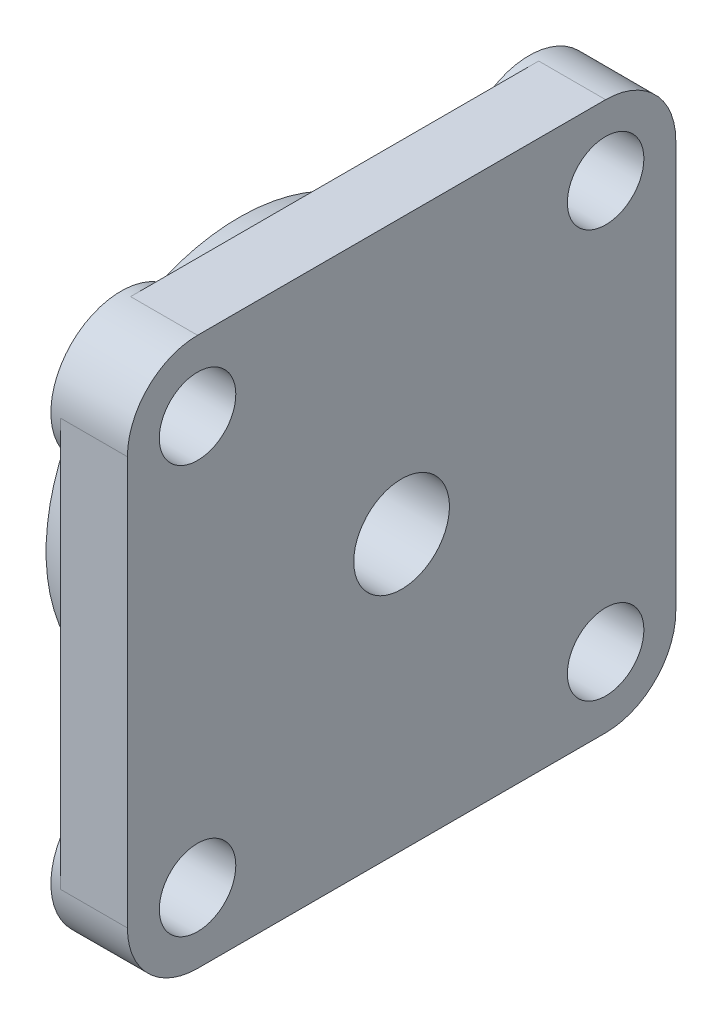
ISO-10303-21;
HEADER;
FILE_DESCRIPTION(('STEP AP214'),'2;1');
FILE_NAME('part.step','',(''),(''),'','','');
FILE_SCHEMA(('AUTOMOTIVE_DESIGN { 1 0 10303 214 1 1 1 1 }'));
ENDSEC;
DATA;
#1=APPLICATION_CONTEXT('core data for automotive mechanical design processes');
#2=APPLICATION_PROTOCOL_DEFINITION('international standard','automotive_design',2000,#1);
#3=PRODUCT_CONTEXT('',#1,'mechanical');
#4=PRODUCT('Part','Part','',(#3));
#5=PRODUCT_RELATED_PRODUCT_CATEGORY('part','',(#4));
#6=PRODUCT_DEFINITION_FORMATION('','',#4);
#7=PRODUCT_DEFINITION_CONTEXT('part definition',#1,'design');
#8=PRODUCT_DEFINITION('design','',#6,#7);
#9=PRODUCT_DEFINITION_SHAPE('','',#8);
#10=(LENGTH_UNIT() NAMED_UNIT(*) SI_UNIT(.MILLI.,.METRE.));
#11=(NAMED_UNIT(*) PLANE_ANGLE_UNIT() SI_UNIT($,.RADIAN.));
#12=(NAMED_UNIT(*) SI_UNIT($,.STERADIAN.) SOLID_ANGLE_UNIT());
#13=UNCERTAINTY_MEASURE_WITH_UNIT(LENGTH_MEASURE(1.E-05),#10,'distance_accuracy_value','');
#14=(GEOMETRIC_REPRESENTATION_CONTEXT(3) GLOBAL_UNCERTAINTY_ASSIGNED_CONTEXT((#13)) GLOBAL_UNIT_ASSIGNED_CONTEXT((#10,
#11,#12)) REPRESENTATION_CONTEXT('',''));
#15=CARTESIAN_POINT('',(0.,0.,0.));
#16=DIRECTION('',(0.,0.,1.));
#17=DIRECTION('',(1.,0.,0.));
#18=AXIS2_PLACEMENT_3D('',#15,#16,#17);
#19=CARTESIAN_POINT('',(-12.,-15.8419293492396,-27.7074869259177));
#20=CARTESIAN_POINT('',(-12.,-15.8419293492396,-35.1684321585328));
#21=CARTESIAN_POINT('',(-12.,-15.8419293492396,-35.2430416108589));
#22=CARTESIAN_POINT('',(-12.,-15.8419293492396,-35.6056914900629));
#23=B_SPLINE_CURVE_WITH_KNOTS('',1,(#19,#20,#21,#22),.UNSPECIFIED.,.F.,.F.,(2,1,1,2),(0.,1.,
1.01,1.05860642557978),.UNSPECIFIED.);
#24=DIRECTION('',(0.,1.,0.));
#25=VECTOR('',#24,1.);
#26=SURFACE_OF_LINEAR_EXTRUSION('',#23,#25);
#27=CARTESIAN_POINT('',(-12.,0.,0.));
#28=DIRECTION('',(1.,0.,0.));
#29=DIRECTION('',(0.,0.,-1.));
#30=AXIS2_PLACEMENT_3D('',#27,#28,#29);
#31=CIRCLE('',#30,30.254833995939);
#32=CARTESIAN_POINT('',(-12.,-12.1511377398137,-27.7074869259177));
#33=VERTEX_POINT('',#32);
#34=CARTESIAN_POINT('',(-12.,12.1511377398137,-27.7074869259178));
#35=VERTEX_POINT('',#34);
#36=EDGE_CURVE('E516',#33,#35,#31,.T.);
#37=ORIENTED_EDGE('',*,*,#36,.F.);
#38=DIRECTION('',(0.,0.707106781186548,0.707106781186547));
#39=VECTOR('',#38,1.);
#40=CARTESIAN_POINT('',(-12.,-18.1864815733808,-33.7428307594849));
#41=LINE('',#40,#39);
#42=CARTESIAN_POINT('',(-12.,-15.8419293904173,-31.3982785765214));
#43=VERTEX_POINT('',#42);
#44=EDGE_CURVE('E961',#43,#33,#41,.T.);
#45=ORIENTED_EDGE('',*,*,#44,.F.);
#46=CARTESIAN_POINT('',(-12.,0.,0.));
#47=DIRECTION('',(1.,0.,0.));
#48=DIRECTION('',(0.,0.,-1.));
#49=AXIS2_PLACEMENT_3D('',#46,#47,#48);
#50=CIRCLE('',#49,35.1684321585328);
#51=CARTESIAN_POINT('',(-12.,15.8419293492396,-31.3982785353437));
#52=VERTEX_POINT('',#51);
#53=EDGE_CURVE('E512',#52,#43,#50,.F.);
#54=ORIENTED_EDGE('',*,*,#53,.F.);
#55=DIRECTION('',(0.,0.707106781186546,-0.707106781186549));
#56=VECTOR('',#55,1.);
#57=CARTESIAN_POINT('',(-12.,18.1864815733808,-33.7428307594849));
#58=LINE('',#57,#56);
#59=EDGE_CURVE('E233',#35,#52,#58,.T.);
#60=ORIENTED_EDGE('',*,*,#59,.F.);
#61=EDGE_LOOP('',(#37,#45,#54,#60));
#62=FACE_BOUND('',#61,.T.);
#63=ADVANCED_FACE('F16',(#62),#26,.T.);
#64=CARTESIAN_POINT('',(-12.,-35.2131978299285,15.8419293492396));
#65=DIRECTION('',(1.,0.,0.));
#66=DIRECTION('',(0.,0.,-1.));
#67=AXIS2_PLACEMENT_3D('',#64,#65,#66);
#68=PLANE('',#67);
#69=DIRECTION('',(0.,0.707106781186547,-0.707106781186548));
#70=VECTOR('',#69,1.);
#71=CARTESIAN_POINT('',(-12.,-33.7428307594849,18.1864815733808));
#72=LINE('',#71,#70);
#73=CARTESIAN_POINT('',(-12.,-31.3982785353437,15.8419293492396));
#74=VERTEX_POINT('',#73);
#75=CARTESIAN_POINT('',(-12.,-27.7074869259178,12.1511377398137));
#76=VERTEX_POINT('',#75);
#77=EDGE_CURVE('E405',#74,#76,#72,.T.);
#78=ORIENTED_EDGE('',*,*,#77,.F.);
#79=CARTESIAN_POINT('',(-12.,0.,0.));
#80=DIRECTION('',(1.,0.,0.));
#81=DIRECTION('',(0.,0.,-1.));
#82=AXIS2_PLACEMENT_3D('',#79,#80,#81);
#83=CIRCLE('',#82,35.1684321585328);
#84=CARTESIAN_POINT('',(-12.,-31.3982785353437,-15.8419293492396));
#85=VERTEX_POINT('',#84);
#86=EDGE_CURVE('E509',#85,#74,#83,.F.);
#87=ORIENTED_EDGE('',*,*,#86,.F.);
#88=DIRECTION('',(0.,-0.707106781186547,-0.707106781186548));
#89=VECTOR('',#88,1.);
#90=CARTESIAN_POINT('',(-12.,-33.7428307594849,-18.1864815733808));
#91=LINE('',#90,#89);
#92=CARTESIAN_POINT('',(-12.,-27.7074869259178,-12.1511377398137));
#93=VERTEX_POINT('',#92);
#94=EDGE_CURVE('E311',#93,#85,#91,.T.);
#95=ORIENTED_EDGE('',*,*,#94,.F.);
#96=CARTESIAN_POINT('',(-12.,0.,0.));
#97=DIRECTION('',(1.,0.,0.));
#98=DIRECTION('',(0.,0.,-1.));
#99=AXIS2_PLACEMENT_3D('',#96,#97,#98);
#100=CIRCLE('',#99,30.254833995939);
#101=EDGE_CURVE('E209',#76,#93,#100,.T.);
#102=ORIENTED_EDGE('',*,*,#101,.F.);
#103=EDGE_LOOP('',(#78,#87,#95,#102));
#104=FACE_BOUND('',#103,.T.);
#105=ADVANCED_FACE('F526',(#104),#68,.T.);
#106=CARTESIAN_POINT('',(-12.,-15.8419293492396,35.6056914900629));
#107=CARTESIAN_POINT('',(-12.,-15.8419293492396,35.2430416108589));
#108=CARTESIAN_POINT('',(-12.,-15.8419293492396,35.1684321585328));
#109=CARTESIAN_POINT('',(-12.,-15.8419293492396,27.7074869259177));
#110=B_SPLINE_CURVE_WITH_KNOTS('',1,(#106,#107,#108,#109),.UNSPECIFIED.,.F.,.F.,(2,1,1,2),
(-0.0586064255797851,-0.01,0.,1.),.UNSPECIFIED.);
#111=DIRECTION('',(0.,1.,0.));
#112=VECTOR('',#111,1.);
#113=SURFACE_OF_LINEAR_EXTRUSION('',#110,#112);
#114=CARTESIAN_POINT('',(-12.,0.,0.));
#115=DIRECTION('',(1.,0.,0.));
#116=DIRECTION('',(0.,0.,-1.));
#117=AXIS2_PLACEMENT_3D('',#114,#115,#116);
#118=CIRCLE('',#117,30.254833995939);
#119=CARTESIAN_POINT('',(-12.,12.1511377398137,27.7074869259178));
#120=VERTEX_POINT('',#119);
#121=CARTESIAN_POINT('',(-12.,-12.1511377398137,27.7074869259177));
#122=VERTEX_POINT('',#121);
#123=EDGE_CURVE('E20',#120,#122,#118,.T.);
#124=ORIENTED_EDGE('',*,*,#123,.F.);
#125=DIRECTION('',(0.,-0.707106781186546,-0.707106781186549));
#126=VECTOR('',#125,1.);
#127=CARTESIAN_POINT('',(-12.,18.1864815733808,33.7428307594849));
#128=LINE('',#127,#126);
#129=CARTESIAN_POINT('',(-12.,15.8419295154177,31.3982787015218));
#130=VERTEX_POINT('',#129);
#131=EDGE_CURVE('E203',#130,#120,#128,.T.);
#132=ORIENTED_EDGE('',*,*,#131,.F.);
#133=CARTESIAN_POINT('',(-12.,0.,0.));
#134=DIRECTION('',(1.,0.,0.));
#135=DIRECTION('',(0.,0.,-1.));
#136=AXIS2_PLACEMENT_3D('',#133,#134,#135);
#137=CIRCLE('',#136,35.1684321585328);
#138=CARTESIAN_POINT('',(-12.,-15.8419293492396,31.3982785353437));
#139=VERTEX_POINT('',#138);
#140=EDGE_CURVE('E507',#139,#130,#137,.F.);
#141=ORIENTED_EDGE('',*,*,#140,.F.);
#142=DIRECTION('',(0.,-0.707106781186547,0.707106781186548));
#143=VECTOR('',#142,1.);
#144=CARTESIAN_POINT('',(-12.,-18.1864815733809,33.7428307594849));
#145=LINE('',#144,#143);
#146=EDGE_CURVE('E206',#122,#139,#145,.T.);
#147=ORIENTED_EDGE('',*,*,#146,.F.);
#148=EDGE_LOOP('',(#124,#132,#141,#147));
#149=FACE_BOUND('',#148,.T.);
#150=ADVANCED_FACE('F201',(#149),#113,.T.);
#151=CARTESIAN_POINT('',(-12.,27.6627212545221,15.8419293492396));
#152=DIRECTION('',(1.,0.,0.));
#153=DIRECTION('',(0.,0.,-1.));
#154=AXIS2_PLACEMENT_3D('',#151,#152,#153);
#155=PLANE('',#154);
#156=DIRECTION('',(0.,-0.707106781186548,0.707106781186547));
#157=VECTOR('',#156,1.);
#158=CARTESIAN_POINT('',(-12.,33.7428307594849,-18.1864815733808));
#159=LINE('',#158,#157);
#160=CARTESIAN_POINT('',(-12.,31.3982785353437,-15.8419293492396));
#161=VERTEX_POINT('',#160);
#162=CARTESIAN_POINT('',(-12.,27.7074869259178,-12.1511377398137));
#163=VERTEX_POINT('',#162);
#164=EDGE_CURVE('E237',#161,#163,#159,.T.);
#165=ORIENTED_EDGE('',*,*,#164,.F.);
#166=CARTESIAN_POINT('',(-12.,0.,0.));
#167=DIRECTION('',(1.,0.,0.));
#168=DIRECTION('',(0.,0.,-1.));
#169=AXIS2_PLACEMENT_3D('',#166,#167,#168);
#170=CIRCLE('',#169,35.1684321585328);
#171=CARTESIAN_POINT('',(-12.,31.3982785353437,15.8419293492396));
#172=VERTEX_POINT('',#171);
#173=EDGE_CURVE('E432',#172,#161,#170,.F.);
#174=ORIENTED_EDGE('',*,*,#173,.F.);
#175=DIRECTION('',(0.,0.707106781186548,0.707106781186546));
#176=VECTOR('',#175,1.);
#177=CARTESIAN_POINT('',(-12.,33.7428307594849,18.1864815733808));
#178=LINE('',#177,#176);
#179=CARTESIAN_POINT('',(-12.,27.7074869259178,12.1511377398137));
#180=VERTEX_POINT('',#179);
#181=EDGE_CURVE('E319',#180,#172,#178,.T.);
#182=ORIENTED_EDGE('',*,*,#181,.F.);
#183=CARTESIAN_POINT('',(-12.,0.,0.));
#184=DIRECTION('',(1.,0.,0.));
#185=DIRECTION('',(0.,0.,-1.));
#186=AXIS2_PLACEMENT_3D('',#183,#184,#185);
#187=CIRCLE('',#186,30.2548339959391);
#188=EDGE_CURVE('E401',#163,#180,#187,.T.);
#189=ORIENTED_EDGE('',*,*,#188,.F.);
#190=EDGE_LOOP('',(#165,#174,#182,#189));
#191=FACE_BOUND('',#190,.T.);
#192=ADVANCED_FACE('F932',(#191),#155,.T.);
#193=CARTESIAN_POINT('',(-10.5,0.,0.));
#194=DIRECTION('',(1.,0.,0.));
#195=DIRECTION('',(0.,0.,-1.));
#196=AXIS2_PLACEMENT_3D('',#193,#194,#195);
#197=CYLINDRICAL_SURFACE('',#196,30.254833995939);
#198=ORIENTED_EDGE('',*,*,#123,.T.);
#199=DIRECTION('',(1.,0.,0.));
#200=VECTOR('',#199,1.);
#201=CARTESIAN_POINT('',(-12.,-12.1511377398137,27.7074869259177));
#202=LINE('',#201,#200);
#203=CARTESIAN_POINT('',(-10.5,-12.1511377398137,27.7074869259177));
#204=VERTEX_POINT('',#203);
#205=EDGE_CURVE('E411',#204,#122,#202,.F.);
#206=ORIENTED_EDGE('',*,*,#205,.F.);
#207=CARTESIAN_POINT('',(-10.5,0.,0.));
#208=DIRECTION('',(1.,0.,0.));
#209=DIRECTION('',(0.,0.,-1.));
#210=AXIS2_PLACEMENT_3D('',#207,#208,#209);
#211=CIRCLE('',#210,30.254833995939);
#212=CARTESIAN_POINT('',(-10.5,12.1511377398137,27.7074869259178));
#213=VERTEX_POINT('',#212);
#214=EDGE_CURVE('E214',#213,#204,#211,.T.);
#215=ORIENTED_EDGE('',*,*,#214,.F.);
#216=DIRECTION('',(1.,0.,0.));
#217=VECTOR('',#216,1.);
#218=CARTESIAN_POINT('',(-12.,12.1511377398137,27.7074869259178));
#219=LINE('',#218,#217);
#220=EDGE_CURVE('E211',#120,#213,#219,.T.);
#221=ORIENTED_EDGE('',*,*,#220,.F.);
#222=EDGE_LOOP('',(#198,#206,#215,#221));
#223=FACE_BOUND('',#222,.T.);
#224=ADVANCED_FACE('F212',(#223),#197,.T.);
#225=CARTESIAN_POINT('',(-10.5,0.,0.));
#226=DIRECTION('',(1.,0.,0.));
#227=DIRECTION('',(0.,0.,-1.));
#228=AXIS2_PLACEMENT_3D('',#225,#226,#227);
#229=CYLINDRICAL_SURFACE('',#228,30.254833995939);
#230=ORIENTED_EDGE('',*,*,#101,.T.);
#231=DIRECTION('',(1.,0.,0.));
#232=VECTOR('',#231,1.);
#233=CARTESIAN_POINT('',(-12.,-27.7074869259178,-12.1511377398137));
#234=LINE('',#233,#232);
#235=CARTESIAN_POINT('',(-10.5,-27.7074869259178,-12.1511377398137));
#236=VERTEX_POINT('',#235);
#237=EDGE_CURVE('E393',#236,#93,#234,.F.);
#238=ORIENTED_EDGE('',*,*,#237,.F.);
#239=CARTESIAN_POINT('',(-10.5,0.,0.));
#240=DIRECTION('',(1.,0.,0.));
#241=DIRECTION('',(0.,0.,-1.));
#242=AXIS2_PLACEMENT_3D('',#239,#240,#241);
#243=CIRCLE('',#242,30.254833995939);
#244=CARTESIAN_POINT('',(-10.5,-27.7074869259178,12.1511377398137));
#245=VERTEX_POINT('',#244);
#246=EDGE_CURVE('E392',#245,#236,#243,.T.);
#247=ORIENTED_EDGE('',*,*,#246,.F.);
#248=DIRECTION('',(1.,0.,0.));
#249=VECTOR('',#248,1.);
#250=CARTESIAN_POINT('',(-12.,-27.7074869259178,12.1511377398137));
#251=LINE('',#250,#249);
#252=EDGE_CURVE('E402',#76,#245,#251,.T.);
#253=ORIENTED_EDGE('',*,*,#252,.F.);
#254=EDGE_LOOP('',(#230,#238,#247,#253));
#255=FACE_BOUND('',#254,.T.);
#256=ADVANCED_FACE('F520',(#255),#229,.T.);
#257=CARTESIAN_POINT('',(-10.5,0.,0.));
#258=DIRECTION('',(1.,0.,0.));
#259=DIRECTION('',(0.,0.,-1.));
#260=AXIS2_PLACEMENT_3D('',#257,#258,#259);
#261=CYLINDRICAL_SURFACE('',#260,30.254833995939);
#262=ORIENTED_EDGE('',*,*,#36,.T.);
#263=DIRECTION('',(1.,0.,0.));
#264=VECTOR('',#263,1.);
#265=CARTESIAN_POINT('',(-12.,12.1511377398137,-27.7074869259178));
#266=LINE('',#265,#264);
#267=CARTESIAN_POINT('',(-10.5,12.1511377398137,-27.7074869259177));
#268=VERTEX_POINT('',#267);
#269=EDGE_CURVE('E236',#268,#35,#266,.F.);
#270=ORIENTED_EDGE('',*,*,#269,.F.);
#271=CARTESIAN_POINT('',(-10.5,0.,0.));
#272=DIRECTION('',(1.,0.,0.));
#273=DIRECTION('',(0.,0.,-1.));
#274=AXIS2_PLACEMENT_3D('',#271,#272,#273);
#275=CIRCLE('',#274,30.254833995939);
#276=CARTESIAN_POINT('',(-10.5,-12.1511377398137,-27.7074869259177));
#277=VERTEX_POINT('',#276);
#278=EDGE_CURVE('E326',#277,#268,#275,.T.);
#279=ORIENTED_EDGE('',*,*,#278,.F.);
#280=DIRECTION('',(1.,0.,0.));
#281=VECTOR('',#280,1.);
#282=CARTESIAN_POINT('',(-12.,-12.1511377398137,-27.7074869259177));
#283=LINE('',#282,#281);
#284=EDGE_CURVE('E246',#33,#277,#283,.T.);
#285=ORIENTED_EDGE('',*,*,#284,.F.);
#286=EDGE_LOOP('',(#262,#270,#279,#285));
#287=FACE_BOUND('',#286,.T.);
#288=ADVANCED_FACE('F911',(#287),#261,.T.);
#289=CARTESIAN_POINT('',(-10.5,0.,0.));
#290=DIRECTION('',(1.,0.,0.));
#291=DIRECTION('',(0.,0.,-1.));
#292=AXIS2_PLACEMENT_3D('',#289,#290,#291);
#293=CYLINDRICAL_SURFACE('',#292,30.2548339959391);
#294=ORIENTED_EDGE('',*,*,#188,.T.);
#295=DIRECTION('',(1.,0.,0.));
#296=VECTOR('',#295,1.);
#297=CARTESIAN_POINT('',(-12.,27.7074869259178,12.1511377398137));
#298=LINE('',#297,#296);
#299=CARTESIAN_POINT('',(-10.5,27.7074869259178,12.1511377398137));
#300=VERTEX_POINT('',#299);
#301=EDGE_CURVE('E218',#300,#180,#298,.F.);
#302=ORIENTED_EDGE('',*,*,#301,.F.);
#303=CARTESIAN_POINT('',(-10.5,0.,0.));
#304=DIRECTION('',(1.,0.,0.));
#305=DIRECTION('',(0.,0.,-1.));
#306=AXIS2_PLACEMENT_3D('',#303,#304,#305);
#307=CIRCLE('',#306,30.2548339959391);
#308=CARTESIAN_POINT('',(-10.5,27.7074869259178,-12.1511377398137));
#309=VERTEX_POINT('',#308);
#310=EDGE_CURVE('E310',#309,#300,#307,.T.);
#311=ORIENTED_EDGE('',*,*,#310,.F.);
#312=DIRECTION('',(1.,0.,0.));
#313=VECTOR('',#312,1.);
#314=CARTESIAN_POINT('',(-12.,27.7074869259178,-12.1511377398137));
#315=LINE('',#314,#313);
#316=EDGE_CURVE('E240',#163,#309,#315,.T.);
#317=ORIENTED_EDGE('',*,*,#316,.F.);
#318=EDGE_LOOP('',(#294,#302,#311,#317));
#319=FACE_BOUND('',#318,.T.);
#320=ADVANCED_FACE('F904',(#319),#293,.T.);
#321=CARTESIAN_POINT('',(-12.,-27.7074869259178,-12.1511377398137));
#322=DIRECTION('',(0.,-0.707106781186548,0.707106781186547));
#323=DIRECTION('',(0.,-0.707106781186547,-0.707106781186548));
#324=AXIS2_PLACEMENT_3D('',#321,#322,#323);
#325=PLANE('',#324);
#326=CARTESIAN_POINT('',(-12.,-39.778174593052,-24.221825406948));
#327=CARTESIAN_POINT('',(-12.,-39.4290122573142,-23.8726630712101));
#328=CARTESIAN_POINT('',(-12.,-39.0798499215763,-23.5235007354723));
#329=CARTESIAN_POINT('',(-12.,-38.3815252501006,-22.8251760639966));
#330=CARTESIAN_POINT('',(-12.,-38.0323629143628,-22.4760137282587));
#331=CARTESIAN_POINT('',(-12.,-37.3340382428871,-21.777689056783));
#332=CARTESIAN_POINT('',(-12.,-36.9848759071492,-21.4285267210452));
#333=CARTESIAN_POINT('',(-12.,-36.2865512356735,-20.7302020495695));
#334=CARTESIAN_POINT('',(-12.,-35.9373888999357,-20.3810397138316));
#335=CARTESIAN_POINT('',(-12.,-35.23906422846,-19.6827150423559));
#336=CARTESIAN_POINT('',(-12.,-34.8899018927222,-19.3335527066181));
#337=CARTESIAN_POINT('',(-12.,-34.1915772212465,-18.6352280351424));
#338=CARTESIAN_POINT('',(-12.,-33.8424148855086,-18.2860656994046));
#339=CARTESIAN_POINT('',(-12.,-33.1440902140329,-17.5877410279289));
#340=CARTESIAN_POINT('',(-12.,-32.7949278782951,-17.238578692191));
#341=CARTESIAN_POINT('',(-12.,-32.0966032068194,-16.5402540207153));
#342=CARTESIAN_POINT('',(-12.,-31.7474408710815,-16.1910916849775));
#343=CARTESIAN_POINT('',(-12.,-31.3982785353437,-15.8419293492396));
#344=B_SPLINE_CURVE_WITH_KNOTS('',3,(#326,#327,#328,#329,#330,#331,#332,#333,#334,#335,#336,
#337,#338,#339,#340,#341,#342,#343),.UNSPECIFIED.,.F.,.F.,(4,2,2,2,2,2,2,2,4),(0.,
1.481370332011,2.962740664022,4.44411099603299,5.92548132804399,7.406851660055,8.88822199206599,
10.369592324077,11.850962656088),.UNSPECIFIED.);
#345=CARTESIAN_POINT('',(-12.,-39.778174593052,-24.221825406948));
#346=VERTEX_POINT('',#345);
#347=EDGE_CURVE('E247',#346,#85,#344,.T.);
#348=ORIENTED_EDGE('',*,*,#347,.F.);
#349=DIRECTION('',(-1.,0.,0.));
#350=VECTOR('',#349,1.);
#351=CARTESIAN_POINT('',(-11.25,-39.778174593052,-24.221825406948));
#352=LINE('',#351,#350);
#353=CARTESIAN_POINT('',(-10.5,-39.778174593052,-24.221825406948));
#354=VERTEX_POINT('',#353);
#355=EDGE_CURVE('E243',#354,#346,#352,.T.);
#356=ORIENTED_EDGE('',*,*,#355,.F.);
#357=CARTESIAN_POINT('',(-10.5,-27.7074869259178,-12.1511377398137));
#358=CARTESIAN_POINT('',(-10.5,-28.2104322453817,-12.6540830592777));
#359=CARTESIAN_POINT('',(-10.5,-28.7133775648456,-13.1570283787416));
#360=CARTESIAN_POINT('',(-10.5,-29.7192682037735,-14.1629190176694));
#361=CARTESIAN_POINT('',(-10.5,-30.2222135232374,-14.6658643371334));
#362=CARTESIAN_POINT('',(-10.5,-31.2281041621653,-15.6717549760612));
#363=CARTESIAN_POINT('',(-10.5,-31.7310494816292,-16.1747002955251));
#364=CARTESIAN_POINT('',(-10.5,-32.736940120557,-17.180590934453));
#365=CARTESIAN_POINT('',(-10.5,-33.239885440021,-17.6835362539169));
#366=CARTESIAN_POINT('',(-10.5,-34.2457760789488,-18.6894268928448));
#367=CARTESIAN_POINT('',(-10.5,-34.7487213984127,-19.1923722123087));
#368=CARTESIAN_POINT('',(-10.5,-35.7546120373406,-20.1982628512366));
#369=CARTESIAN_POINT('',(-10.5,-36.2575573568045,-20.7012081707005));
#370=CARTESIAN_POINT('',(-10.5,-37.2634479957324,-21.7070988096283));
#371=CARTESIAN_POINT('',(-10.5,-37.7663933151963,-22.2100441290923));
#372=CARTESIAN_POINT('',(-10.5,-38.7722839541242,-23.2159347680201));
#373=CARTESIAN_POINT('',(-10.5,-39.2752292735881,-23.7188800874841));
#374=CARTESIAN_POINT('',(-10.5,-39.778174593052,-24.221825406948));
#375=B_SPLINE_CURVE_WITH_KNOTS('',3,(#357,#358,#359,#360,#361,#362,#363,#364,#365,#366,#367,
#368,#369,#370,#371,#372,#373,#374),.UNSPECIFIED.,.F.,.F.,(4,2,2,2,2,2,2,2,4),(0.,
2.13381627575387,4.26763255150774,6.4014488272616,8.53526510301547,10.6690813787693,
12.8028976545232,14.9367139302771,17.0705302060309),.UNSPECIFIED.);
#376=EDGE_CURVE('E388',#236,#354,#375,.T.);
#377=ORIENTED_EDGE('',*,*,#376,.F.);
#378=ORIENTED_EDGE('',*,*,#237,.T.);
#379=ORIENTED_EDGE('',*,*,#94,.T.);
#380=EDGE_LOOP('',(#348,#356,#377,#378,#379));
#381=FACE_BOUND('',#380,.T.);
#382=ADVANCED_FACE('F530',(#381),#325,.T.);
#383=CARTESIAN_POINT('',(-12.,-24.221825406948,-39.778174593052));
#384=DIRECTION('',(0.,0.707106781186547,-0.707106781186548));
#385=DIRECTION('',(0.,0.707106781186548,0.707106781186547));
#386=AXIS2_PLACEMENT_3D('',#383,#384,#385);
#387=PLANE('',#386);
#388=ORIENTED_EDGE('',*,*,#44,.T.);
#389=ORIENTED_EDGE('',*,*,#284,.T.);
#390=CARTESIAN_POINT('',(-10.5,-24.221825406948,-39.778174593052));
#391=CARTESIAN_POINT('',(-10.5,-23.718880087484,-39.2752292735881));
#392=CARTESIAN_POINT('',(-10.5,-23.2159347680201,-38.7722839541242));
#393=CARTESIAN_POINT('',(-10.5,-22.2100441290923,-37.7663933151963));
#394=CARTESIAN_POINT('',(-10.5,-21.7070988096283,-37.2634479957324));
#395=CARTESIAN_POINT('',(-10.5,-20.7012081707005,-36.2575573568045));
#396=CARTESIAN_POINT('',(-10.5,-20.1982628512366,-35.7546120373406));
#397=CARTESIAN_POINT('',(-10.5,-19.1923722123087,-34.7487213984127));
#398=CARTESIAN_POINT('',(-10.5,-18.6894268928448,-34.2457760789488));
#399=CARTESIAN_POINT('',(-10.5,-17.6835362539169,-33.239885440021));
#400=CARTESIAN_POINT('',(-10.5,-17.180590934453,-32.736940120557));
#401=CARTESIAN_POINT('',(-10.5,-16.1747002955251,-31.7310494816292));
#402=CARTESIAN_POINT('',(-10.5,-15.6717549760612,-31.2281041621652));
#403=CARTESIAN_POINT('',(-10.5,-14.6658643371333,-30.2222135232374));
#404=CARTESIAN_POINT('',(-10.5,-14.1629190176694,-29.7192682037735));
#405=CARTESIAN_POINT('',(-10.5,-13.1570283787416,-28.7133775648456));
#406=CARTESIAN_POINT('',(-10.5,-12.6540830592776,-28.2104322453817));
#407=CARTESIAN_POINT('',(-10.5,-12.1511377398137,-27.7074869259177));
#408=B_SPLINE_CURVE_WITH_KNOTS('',3,(#390,#391,#392,#393,#394,#395,#396,#397,#398,#399,#400,
#401,#402,#403,#404,#405,#406,#407),.UNSPECIFIED.,.F.,.F.,(4,2,2,2,2,2,2,2,4),(0.,
2.13381627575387,4.26763255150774,6.40144882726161,8.53526510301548,10.6690813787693,
12.8028976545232,14.9367139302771,17.070530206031),.UNSPECIFIED.);
#409=CARTESIAN_POINT('',(-10.5,-24.221825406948,-39.778174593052));
#410=VERTEX_POINT('',#409);
#411=EDGE_CURVE('E350',#410,#277,#408,.T.);
#412=ORIENTED_EDGE('',*,*,#411,.F.);
#413=DIRECTION('',(1.,0.,0.));
#414=VECTOR('',#413,1.);
#415=CARTESIAN_POINT('',(-12.,-24.221825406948,-39.778174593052));
#416=LINE('',#415,#414);
#417=CARTESIAN_POINT('',(-12.,-24.221825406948,-39.778174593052));
#418=VERTEX_POINT('',#417);
#419=EDGE_CURVE('E254',#410,#418,#416,.F.);
#420=ORIENTED_EDGE('',*,*,#419,.T.);
#421=CARTESIAN_POINT('',(-12.,-15.8419293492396,-31.3982785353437));
#422=CARTESIAN_POINT('',(-12.,-16.1910916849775,-31.7474408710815));
#423=CARTESIAN_POINT('',(-12.,-16.5402540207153,-32.0966032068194));
#424=CARTESIAN_POINT('',(-12.,-17.238578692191,-32.7949278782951));
#425=CARTESIAN_POINT('',(-12.,-17.5877410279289,-33.1440902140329));
#426=CARTESIAN_POINT('',(-12.,-18.2860656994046,-33.8424148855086));
#427=CARTESIAN_POINT('',(-12.,-18.6352280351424,-34.1915772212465));
#428=CARTESIAN_POINT('',(-12.,-19.3335527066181,-34.8899018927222));
#429=CARTESIAN_POINT('',(-12.,-19.682715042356,-35.23906422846));
#430=CARTESIAN_POINT('',(-12.,-20.3810397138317,-35.9373888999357));
#431=CARTESIAN_POINT('',(-12.,-20.7302020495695,-36.2865512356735));
#432=CARTESIAN_POINT('',(-12.,-21.4285267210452,-36.9848759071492));
#433=CARTESIAN_POINT('',(-12.,-21.777689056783,-37.3340382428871));
#434=CARTESIAN_POINT('',(-12.,-22.4760137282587,-38.0323629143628));
#435=CARTESIAN_POINT('',(-12.,-22.8251760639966,-38.3815252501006));
#436=CARTESIAN_POINT('',(-12.,-23.5235007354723,-39.0798499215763));
#437=CARTESIAN_POINT('',(-12.,-23.8726630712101,-39.4290122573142));
#438=CARTESIAN_POINT('',(-12.,-24.221825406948,-39.778174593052));
#439=B_SPLINE_CURVE_WITH_KNOTS('',3,(#421,#422,#423,#424,#425,#426,#427,#428,#429,#430,#431,
#432,#433,#434,#435,#436,#437,#438),.UNSPECIFIED.,.F.,.F.,(4,2,2,2,2,2,2,2,4),(0.,
1.481370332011,2.962740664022,4.444110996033,5.925481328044,7.406851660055,8.88822199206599,
10.369592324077,11.850962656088),.UNSPECIFIED.);
#440=EDGE_CURVE('E355',#43,#418,#439,.T.);
#441=ORIENTED_EDGE('',*,*,#440,.F.);
#442=EDGE_LOOP('',(#388,#389,#412,#420,#441));
#443=FACE_BOUND('',#442,.T.);
#444=ADVANCED_FACE('F889',(#443),#387,.T.);
#445=CARTESIAN_POINT('',(-12.,39.778174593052,-24.221825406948));
#446=DIRECTION('',(0.,0.707106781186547,0.707106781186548));
#447=DIRECTION('',(0.,-0.707106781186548,0.707106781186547));
#448=AXIS2_PLACEMENT_3D('',#445,#446,#447);
#449=PLANE('',#448);
#450=ORIENTED_EDGE('',*,*,#164,.T.);
#451=ORIENTED_EDGE('',*,*,#316,.T.);
#452=CARTESIAN_POINT('',(-10.5,39.778174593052,-24.221825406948));
#453=CARTESIAN_POINT('',(-10.5,39.2752292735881,-23.718880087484));
#454=CARTESIAN_POINT('',(-10.5,38.7722839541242,-23.2159347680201));
#455=CARTESIAN_POINT('',(-10.5,37.7663933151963,-22.2100441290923));
#456=CARTESIAN_POINT('',(-10.5,37.2634479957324,-21.7070988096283));
#457=CARTESIAN_POINT('',(-10.5,36.2575573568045,-20.7012081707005));
#458=CARTESIAN_POINT('',(-10.5,35.7546120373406,-20.1982628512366));
#459=CARTESIAN_POINT('',(-10.5,34.7487213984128,-19.1923722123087));
#460=CARTESIAN_POINT('',(-10.5,34.2457760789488,-18.6894268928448));
#461=CARTESIAN_POINT('',(-10.5,33.239885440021,-17.6835362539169));
#462=CARTESIAN_POINT('',(-10.5,32.7369401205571,-17.180590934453));
#463=CARTESIAN_POINT('',(-10.5,31.7310494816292,-16.1747002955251));
#464=CARTESIAN_POINT('',(-10.5,31.2281041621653,-15.6717549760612));
#465=CARTESIAN_POINT('',(-10.5,30.2222135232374,-14.6658643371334));
#466=CARTESIAN_POINT('',(-10.5,29.7192682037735,-14.1629190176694));
#467=CARTESIAN_POINT('',(-10.5,28.7133775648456,-13.1570283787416));
#468=CARTESIAN_POINT('',(-10.5,28.2104322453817,-12.6540830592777));
#469=CARTESIAN_POINT('',(-10.5,27.7074869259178,-12.1511377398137));
#470=B_SPLINE_CURVE_WITH_KNOTS('',3,(#452,#453,#454,#455,#456,#457,#458,#459,#460,#461,#462,
#463,#464,#465,#466,#467,#468,#469),.UNSPECIFIED.,.F.,.F.,(4,2,2,2,2,2,2,2,4),(0.,
2.13381627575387,4.26763255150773,6.40144882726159,8.53526510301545,10.6690813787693,
12.8028976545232,14.936713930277,17.0705302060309),.UNSPECIFIED.);
#471=CARTESIAN_POINT('',(-10.5,39.778174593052,-24.221825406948));
#472=VERTEX_POINT('',#471);
#473=EDGE_CURVE('E301',#472,#309,#470,.T.);
#474=ORIENTED_EDGE('',*,*,#473,.F.);
#475=DIRECTION('',(1.,0.,0.));
#476=VECTOR('',#475,1.);
#477=CARTESIAN_POINT('',(-12.,39.778174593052,-24.221825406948));
#478=LINE('',#477,#476);
#479=CARTESIAN_POINT('',(-12.,39.778174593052,-24.221825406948));
#480=VERTEX_POINT('',#479);
#481=EDGE_CURVE('E241',#472,#480,#478,.F.);
#482=ORIENTED_EDGE('',*,*,#481,.T.);
#483=CARTESIAN_POINT('',(-12.,31.3982785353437,-15.8419293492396));
#484=CARTESIAN_POINT('',(-12.,31.7474408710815,-16.1910916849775));
#485=CARTESIAN_POINT('',(-12.,32.0966032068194,-16.5402540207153));
#486=CARTESIAN_POINT('',(-12.,32.7949278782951,-17.238578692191));
#487=CARTESIAN_POINT('',(-12.,33.1440902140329,-17.5877410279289));
#488=CARTESIAN_POINT('',(-12.,33.8424148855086,-18.2860656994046));
#489=CARTESIAN_POINT('',(-12.,34.1915772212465,-18.6352280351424));
#490=CARTESIAN_POINT('',(-12.,34.8899018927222,-19.3335527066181));
#491=CARTESIAN_POINT('',(-12.,35.23906422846,-19.6827150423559));
#492=CARTESIAN_POINT('',(-12.,35.9373888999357,-20.3810397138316));
#493=CARTESIAN_POINT('',(-12.,36.2865512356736,-20.7302020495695));
#494=CARTESIAN_POINT('',(-12.,36.9848759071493,-21.4285267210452));
#495=CARTESIAN_POINT('',(-12.,37.3340382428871,-21.777689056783));
#496=CARTESIAN_POINT('',(-12.,38.0323629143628,-22.4760137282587));
#497=CARTESIAN_POINT('',(-12.,38.3815252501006,-22.8251760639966));
#498=CARTESIAN_POINT('',(-12.,39.0798499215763,-23.5235007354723));
#499=CARTESIAN_POINT('',(-12.,39.4290122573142,-23.8726630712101));
#500=CARTESIAN_POINT('',(-12.,39.778174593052,-24.221825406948));
#501=B_SPLINE_CURVE_WITH_KNOTS('',3,(#483,#484,#485,#486,#487,#488,#489,#490,#491,#492,#493,
#494,#495,#496,#497,#498,#499,#500),.UNSPECIFIED.,.F.,.F.,(4,2,2,2,2,2,2,2,4),(0.,
1.481370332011,2.96274066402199,4.44411099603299,5.92548132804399,7.40685166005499,
8.88822199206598,10.369592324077,11.850962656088),.UNSPECIFIED.);
#502=EDGE_CURVE('E364',#161,#480,#501,.T.);
#503=ORIENTED_EDGE('',*,*,#502,.F.);
#504=EDGE_LOOP('',(#450,#451,#474,#482,#503));
#505=FACE_BOUND('',#504,.T.);
#506=ADVANCED_FACE('F881',(#505),#449,.T.);
#507=CARTESIAN_POINT('',(-12.,12.1511377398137,-27.7074869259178));
#508=DIRECTION('',(0.,-0.707106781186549,-0.707106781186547));
#509=DIRECTION('',(0.,0.707106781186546,-0.707106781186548));
#510=AXIS2_PLACEMENT_3D('',#507,#508,#509);
#511=PLANE('',#510);
#512=CARTESIAN_POINT('',(-12.,24.2218254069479,-39.778174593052));
#513=CARTESIAN_POINT('',(-12.,23.8726630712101,-39.4290122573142));
#514=CARTESIAN_POINT('',(-12.,23.5235007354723,-39.0798499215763));
#515=CARTESIAN_POINT('',(-12.,22.8251760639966,-38.3815252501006));
#516=CARTESIAN_POINT('',(-12.,22.4760137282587,-38.0323629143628));
#517=CARTESIAN_POINT('',(-12.,21.777689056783,-37.3340382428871));
#518=CARTESIAN_POINT('',(-12.,21.4285267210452,-36.9848759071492));
#519=CARTESIAN_POINT('',(-12.,20.7302020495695,-36.2865512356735));
#520=CARTESIAN_POINT('',(-12.,20.3810397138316,-35.9373888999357));
#521=CARTESIAN_POINT('',(-12.,19.6827150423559,-35.23906422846));
#522=CARTESIAN_POINT('',(-12.,19.3335527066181,-34.8899018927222));
#523=CARTESIAN_POINT('',(-12.,18.6352280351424,-34.1915772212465));
#524=CARTESIAN_POINT('',(-12.,18.2860656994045,-33.8424148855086));
#525=CARTESIAN_POINT('',(-12.,17.5877410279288,-33.1440902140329));
#526=CARTESIAN_POINT('',(-12.,17.238578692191,-32.7949278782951));
#527=CARTESIAN_POINT('',(-12.,16.5402540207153,-32.0966032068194));
#528=CARTESIAN_POINT('',(-12.,16.1910916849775,-31.7474408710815));
#529=CARTESIAN_POINT('',(-12.,15.8419293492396,-31.3982785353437));
#530=B_SPLINE_CURVE_WITH_KNOTS('',3,(#512,#513,#514,#515,#516,#517,#518,#519,#520,#521,#522,
#523,#524,#525,#526,#527,#528,#529),.UNSPECIFIED.,.F.,.F.,(4,2,2,2,2,2,2,2,4),(0.,
1.481370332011,2.96274066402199,4.44411099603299,5.92548132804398,7.40685166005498,
8.88822199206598,10.369592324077,11.850962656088),.UNSPECIFIED.);
#531=CARTESIAN_POINT('',(-12.,24.2218254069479,-39.778174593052));
#532=VERTEX_POINT('',#531);
#533=EDGE_CURVE('E277',#532,#52,#530,.T.);
#534=ORIENTED_EDGE('',*,*,#533,.F.);
#535=DIRECTION('',(1.,0.,0.));
#536=VECTOR('',#535,1.);
#537=CARTESIAN_POINT('',(-12.,24.2218254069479,-39.778174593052));
#538=LINE('',#537,#536);
#539=CARTESIAN_POINT('',(-10.5,24.221825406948,-39.778174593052));
#540=VERTEX_POINT('',#539);
#541=EDGE_CURVE('E226',#532,#540,#538,.T.);
#542=ORIENTED_EDGE('',*,*,#541,.T.);
#543=CARTESIAN_POINT('',(-10.5,12.1511377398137,-27.7074869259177));
#544=CARTESIAN_POINT('',(-10.5,12.6540830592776,-28.2104322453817));
#545=CARTESIAN_POINT('',(-10.5,13.1570283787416,-28.7133775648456));
#546=CARTESIAN_POINT('',(-10.5,14.1629190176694,-29.7192682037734));
#547=CARTESIAN_POINT('',(-10.5,14.6658643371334,-30.2222135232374));
#548=CARTESIAN_POINT('',(-10.5,15.6717549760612,-31.2281041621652));
#549=CARTESIAN_POINT('',(-10.5,16.1747002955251,-31.7310494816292));
#550=CARTESIAN_POINT('',(-10.5,17.180590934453,-32.736940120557));
#551=CARTESIAN_POINT('',(-10.5,17.6835362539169,-33.239885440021));
#552=CARTESIAN_POINT('',(-10.5,18.6894268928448,-34.2457760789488));
#553=CARTESIAN_POINT('',(-10.5,19.1923722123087,-34.7487213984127));
#554=CARTESIAN_POINT('',(-10.5,20.1982628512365,-35.7546120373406));
#555=CARTESIAN_POINT('',(-10.5,20.7012081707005,-36.2575573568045));
#556=CARTESIAN_POINT('',(-10.5,21.7070988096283,-37.2634479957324));
#557=CARTESIAN_POINT('',(-10.5,22.2100441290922,-37.7663933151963));
#558=CARTESIAN_POINT('',(-10.5,23.2159347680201,-38.7722839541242));
#559=CARTESIAN_POINT('',(-10.5,23.718880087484,-39.2752292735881));
#560=CARTESIAN_POINT('',(-10.5,24.2218254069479,-39.778174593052));
#561=B_SPLINE_CURVE_WITH_KNOTS('',3,(#543,#544,#545,#546,#547,#548,#549,#550,#551,#552,#553,
#554,#555,#556,#557,#558,#559,#560),.UNSPECIFIED.,.F.,.F.,(4,2,2,2,2,2,2,2,4),(0.,
2.13381627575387,4.26763255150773,6.40144882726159,8.53526510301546,10.6690813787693,
12.8028976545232,14.9367139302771,17.0705302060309),.UNSPECIFIED.);
#562=EDGE_CURVE('E321',#268,#540,#561,.T.);
#563=ORIENTED_EDGE('',*,*,#562,.F.);
#564=ORIENTED_EDGE('',*,*,#269,.T.);
#565=ORIENTED_EDGE('',*,*,#59,.T.);
#566=EDGE_LOOP('',(#534,#542,#563,#564,#565));
#567=FACE_BOUND('',#566,.T.);
#568=ADVANCED_FACE('F874',(#567),#511,.T.);
#569=CARTESIAN_POINT('',(-12.,24.2218254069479,39.778174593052));
#570=DIRECTION('',(0.,-0.707106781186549,0.707106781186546));
#571=DIRECTION('',(0.,-0.707106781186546,-0.707106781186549));
#572=AXIS2_PLACEMENT_3D('',#569,#570,#571);
#573=PLANE('',#572);
#574=ORIENTED_EDGE('',*,*,#131,.T.);
#575=ORIENTED_EDGE('',*,*,#220,.T.);
#576=CARTESIAN_POINT('',(-10.5,24.2218254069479,39.778174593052));
#577=CARTESIAN_POINT('',(-10.5,23.718880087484,39.2752292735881));
#578=CARTESIAN_POINT('',(-10.5,23.2159347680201,38.7722839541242));
#579=CARTESIAN_POINT('',(-10.5,22.2100441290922,37.7663933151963));
#580=CARTESIAN_POINT('',(-10.5,21.7070988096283,37.2634479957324));
#581=CARTESIAN_POINT('',(-10.5,20.7012081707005,36.2575573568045));
#582=CARTESIAN_POINT('',(-10.5,20.1982628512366,35.7546120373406));
#583=CARTESIAN_POINT('',(-10.5,19.1923722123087,34.7487213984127));
#584=CARTESIAN_POINT('',(-10.5,18.6894268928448,34.2457760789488));
#585=CARTESIAN_POINT('',(-10.5,17.6835362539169,33.239885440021));
#586=CARTESIAN_POINT('',(-10.5,17.180590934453,32.736940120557));
#587=CARTESIAN_POINT('',(-10.5,16.1747002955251,31.7310494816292));
#588=CARTESIAN_POINT('',(-10.5,15.6717549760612,31.2281041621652));
#589=CARTESIAN_POINT('',(-10.5,14.6658643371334,30.2222135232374));
#590=CARTESIAN_POINT('',(-10.5,14.1629190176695,29.7192682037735));
#591=CARTESIAN_POINT('',(-10.5,13.1570283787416,28.7133775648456));
#592=CARTESIAN_POINT('',(-10.5,12.6540830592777,28.2104322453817));
#593=CARTESIAN_POINT('',(-10.5,12.1511377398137,27.7074869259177));
#594=B_SPLINE_CURVE_WITH_KNOTS('',3,(#576,#577,#578,#579,#580,#581,#582,#583,#584,#585,#586,
#587,#588,#589,#590,#591,#592,#593),.UNSPECIFIED.,.F.,.F.,(4,2,2,2,2,2,2,2,4),(0.,
2.13381627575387,4.26763255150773,6.40144882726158,8.53526510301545,10.6690813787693,
12.8028976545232,14.936713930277,17.0705302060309),.UNSPECIFIED.);
#595=CARTESIAN_POINT('',(-10.5,24.2218254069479,39.778174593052));
#596=VERTEX_POINT('',#595);
#597=EDGE_CURVE('E426',#596,#213,#594,.T.);
#598=ORIENTED_EDGE('',*,*,#597,.F.);
#599=DIRECTION('',(1.,0.,0.));
#600=VECTOR('',#599,1.);
#601=CARTESIAN_POINT('',(-12.,24.2218254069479,39.778174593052));
#602=LINE('',#601,#600);
#603=CARTESIAN_POINT('',(-12.,24.2218254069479,39.778174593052));
#604=VERTEX_POINT('',#603);
#605=EDGE_CURVE('E224',#596,#604,#602,.F.);
#606=ORIENTED_EDGE('',*,*,#605,.T.);
#607=CARTESIAN_POINT('',(-12.,15.8419293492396,31.3982785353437));
#608=CARTESIAN_POINT('',(-12.,16.1910916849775,31.7474408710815));
#609=CARTESIAN_POINT('',(-12.,16.5402540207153,32.0966032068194));
#610=CARTESIAN_POINT('',(-12.,17.238578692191,32.7949278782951));
#611=CARTESIAN_POINT('',(-12.,17.5877410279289,33.1440902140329));
#612=CARTESIAN_POINT('',(-12.,18.2860656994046,33.8424148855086));
#613=CARTESIAN_POINT('',(-12.,18.6352280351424,34.1915772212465));
#614=CARTESIAN_POINT('',(-12.,19.3335527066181,34.8899018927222));
#615=CARTESIAN_POINT('',(-12.,19.6827150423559,35.23906422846));
#616=CARTESIAN_POINT('',(-12.,20.3810397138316,35.9373888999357));
#617=CARTESIAN_POINT('',(-12.,20.7302020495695,36.2865512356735));
#618=CARTESIAN_POINT('',(-12.,21.4285267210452,36.9848759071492));
#619=CARTESIAN_POINT('',(-12.,21.777689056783,37.3340382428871));
#620=CARTESIAN_POINT('',(-12.,22.4760137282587,38.0323629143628));
#621=CARTESIAN_POINT('',(-12.,22.8251760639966,38.3815252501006));
#622=CARTESIAN_POINT('',(-12.,23.5235007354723,39.0798499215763));
#623=CARTESIAN_POINT('',(-12.,23.8726630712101,39.4290122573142));
#624=CARTESIAN_POINT('',(-12.,24.2218254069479,39.778174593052));
#625=B_SPLINE_CURVE_WITH_KNOTS('',3,(#607,#608,#609,#610,#611,#612,#613,#614,#615,#616,#617,
#618,#619,#620,#621,#622,#623,#624),.UNSPECIFIED.,.F.,.F.,(4,2,2,2,2,2,2,2,4),(0.,
1.48137033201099,2.96274066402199,4.44411099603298,5.92548132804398,7.40685166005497,
8.88822199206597,10.369592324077,11.850962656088),.UNSPECIFIED.);
#626=EDGE_CURVE('E222',#130,#604,#625,.T.);
#627=ORIENTED_EDGE('',*,*,#626,.F.);
#628=EDGE_LOOP('',(#574,#575,#598,#606,#627));
#629=FACE_BOUND('',#628,.T.);
#630=ADVANCED_FACE('F220',(#629),#573,.T.);
#631=CARTESIAN_POINT('',(-12.,27.7074869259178,12.1511377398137));
#632=DIRECTION('',(0.,0.707106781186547,-0.707106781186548));
#633=DIRECTION('',(0.,0.707106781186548,0.707106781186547));
#634=AXIS2_PLACEMENT_3D('',#631,#632,#633);
#635=PLANE('',#634);
#636=CARTESIAN_POINT('',(-12.,39.778174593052,24.221825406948));
#637=CARTESIAN_POINT('',(-12.,39.4290122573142,23.8726630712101));
#638=CARTESIAN_POINT('',(-12.,39.0798499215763,23.5235007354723));
#639=CARTESIAN_POINT('',(-12.,38.3815252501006,22.8251760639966));
#640=CARTESIAN_POINT('',(-12.,38.0323629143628,22.4760137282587));
#641=CARTESIAN_POINT('',(-12.,37.3340382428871,21.777689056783));
#642=CARTESIAN_POINT('',(-12.,36.9848759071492,21.4285267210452));
#643=CARTESIAN_POINT('',(-12.,36.2865512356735,20.7302020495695));
#644=CARTESIAN_POINT('',(-12.,35.9373888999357,20.3810397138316));
#645=CARTESIAN_POINT('',(-12.,35.23906422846,19.6827150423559));
#646=CARTESIAN_POINT('',(-12.,34.8899018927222,19.3335527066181));
#647=CARTESIAN_POINT('',(-12.,34.1915772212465,18.6352280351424));
#648=CARTESIAN_POINT('',(-12.,33.8424148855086,18.2860656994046));
#649=CARTESIAN_POINT('',(-12.,33.1440902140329,17.5877410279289));
#650=CARTESIAN_POINT('',(-12.,32.7949278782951,17.238578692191));
#651=CARTESIAN_POINT('',(-12.,32.0966032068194,16.5402540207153));
#652=CARTESIAN_POINT('',(-12.,31.7474408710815,16.1910916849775));
#653=CARTESIAN_POINT('',(-12.,31.3982785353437,15.8419293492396));
#654=B_SPLINE_CURVE_WITH_KNOTS('',3,(#636,#637,#638,#639,#640,#641,#642,#643,#644,#645,#646,
#647,#648,#649,#650,#651,#652,#653),.UNSPECIFIED.,.F.,.F.,(4,2,2,2,2,2,2,2,4),(0.,
1.481370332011,2.962740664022,4.44411099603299,5.92548132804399,7.40685166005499,
8.88822199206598,10.369592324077,11.850962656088),.UNSPECIFIED.);
#655=CARTESIAN_POINT('',(-12.,39.778174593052,24.221825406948));
#656=VERTEX_POINT('',#655);
#657=EDGE_CURVE('E441',#656,#172,#654,.T.);
#658=ORIENTED_EDGE('',*,*,#657,.F.);
#659=DIRECTION('',(1.,0.,0.));
#660=VECTOR('',#659,1.);
#661=CARTESIAN_POINT('',(-12.,39.778174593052,24.221825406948));
#662=LINE('',#661,#660);
#663=CARTESIAN_POINT('',(-10.5,39.778174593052,24.221825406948));
#664=VERTEX_POINT('',#663);
#665=EDGE_CURVE('E229',#656,#664,#662,.T.);
#666=ORIENTED_EDGE('',*,*,#665,.T.);
#667=CARTESIAN_POINT('',(-10.5,27.7074869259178,12.1511377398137));
#668=CARTESIAN_POINT('',(-10.5,28.2104322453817,12.6540830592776));
#669=CARTESIAN_POINT('',(-10.5,28.7133775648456,13.1570283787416));
#670=CARTESIAN_POINT('',(-10.5,29.7192682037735,14.1629190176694));
#671=CARTESIAN_POINT('',(-10.5,30.2222135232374,14.6658643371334));
#672=CARTESIAN_POINT('',(-10.5,31.2281041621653,15.6717549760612));
#673=CARTESIAN_POINT('',(-10.5,31.7310494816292,16.1747002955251));
#674=CARTESIAN_POINT('',(-10.5,32.736940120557,17.180590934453));
#675=CARTESIAN_POINT('',(-10.5,33.239885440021,17.6835362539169));
#676=CARTESIAN_POINT('',(-10.5,34.2457760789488,18.6894268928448));
#677=CARTESIAN_POINT('',(-10.5,34.7487213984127,19.1923722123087));
#678=CARTESIAN_POINT('',(-10.5,35.7546120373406,20.1982628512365));
#679=CARTESIAN_POINT('',(-10.5,36.2575573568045,20.7012081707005));
#680=CARTESIAN_POINT('',(-10.5,37.2634479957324,21.7070988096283));
#681=CARTESIAN_POINT('',(-10.5,37.7663933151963,22.2100441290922));
#682=CARTESIAN_POINT('',(-10.5,38.7722839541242,23.2159347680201));
#683=CARTESIAN_POINT('',(-10.5,39.2752292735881,23.718880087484));
#684=CARTESIAN_POINT('',(-10.5,39.778174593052,24.2218254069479));
#685=B_SPLINE_CURVE_WITH_KNOTS('',3,(#667,#668,#669,#670,#671,#672,#673,#674,#675,#676,#677,
#678,#679,#680,#681,#682,#683,#684),.UNSPECIFIED.,.F.,.F.,(4,2,2,2,2,2,2,2,4),(0.,
2.13381627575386,4.26763255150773,6.40144882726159,8.53526510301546,10.6690813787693,
12.8028976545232,14.936713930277,17.0705302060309),.UNSPECIFIED.);
#686=EDGE_CURVE('E305',#300,#664,#685,.T.);
#687=ORIENTED_EDGE('',*,*,#686,.F.);
#688=ORIENTED_EDGE('',*,*,#301,.T.);
#689=ORIENTED_EDGE('',*,*,#181,.T.);
#690=EDGE_LOOP('',(#658,#666,#687,#688,#689));
#691=FACE_BOUND('',#690,.T.);
#692=ADVANCED_FACE('F861',(#691),#635,.T.);
#693=CARTESIAN_POINT('',(-12.,-12.1511377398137,27.7074869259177));
#694=DIRECTION('',(0.,0.707106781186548,0.707106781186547));
#695=DIRECTION('',(0.,-0.707106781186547,0.707106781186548));
#696=AXIS2_PLACEMENT_3D('',#693,#694,#695);
#697=PLANE('',#696);
#698=CARTESIAN_POINT('',(-12.,-24.221825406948,39.778174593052));
#699=CARTESIAN_POINT('',(-12.,-23.8726630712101,39.4290122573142));
#700=CARTESIAN_POINT('',(-12.,-23.5235007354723,39.0798499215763));
#701=CARTESIAN_POINT('',(-12.,-22.8251760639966,38.3815252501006));
#702=CARTESIAN_POINT('',(-12.,-22.4760137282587,38.0323629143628));
#703=CARTESIAN_POINT('',(-12.,-21.777689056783,37.3340382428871));
#704=CARTESIAN_POINT('',(-12.,-21.4285267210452,36.9848759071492));
#705=CARTESIAN_POINT('',(-12.,-20.7302020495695,36.2865512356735));
#706=CARTESIAN_POINT('',(-12.,-20.3810397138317,35.9373888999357));
#707=CARTESIAN_POINT('',(-12.,-19.682715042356,35.23906422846));
#708=CARTESIAN_POINT('',(-12.,-19.3335527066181,34.8899018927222));
#709=CARTESIAN_POINT('',(-12.,-18.6352280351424,34.1915772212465));
#710=CARTESIAN_POINT('',(-12.,-18.2860656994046,33.8424148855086));
#711=CARTESIAN_POINT('',(-12.,-17.5877410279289,33.1440902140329));
#712=CARTESIAN_POINT('',(-12.,-17.238578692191,32.7949278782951));
#713=CARTESIAN_POINT('',(-12.,-16.5402540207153,32.0966032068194));
#714=CARTESIAN_POINT('',(-12.,-16.1910916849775,31.7474408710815));
#715=CARTESIAN_POINT('',(-12.,-15.8419293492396,31.3982785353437));
#716=B_SPLINE_CURVE_WITH_KNOTS('',3,(#698,#699,#700,#701,#702,#703,#704,#705,#706,#707,#708,
#709,#710,#711,#712,#713,#714,#715),.UNSPECIFIED.,.F.,.F.,(4,2,2,2,2,2,2,2,4),(0.,
1.481370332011,2.962740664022,4.444110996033,5.92548132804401,7.406851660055,8.88822199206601,
10.369592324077,11.850962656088),.UNSPECIFIED.);
#717=CARTESIAN_POINT('',(-12.,-24.221825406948,39.778174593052));
#718=VERTEX_POINT('',#717);
#719=EDGE_CURVE('E586',#718,#139,#716,.T.);
#720=ORIENTED_EDGE('',*,*,#719,.F.);
#721=DIRECTION('',(-1.,0.,0.));
#722=VECTOR('',#721,1.);
#723=CARTESIAN_POINT('',(-11.25,-24.221825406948,39.778174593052));
#724=LINE('',#723,#722);
#725=CARTESIAN_POINT('',(-10.5,-24.221825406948,39.778174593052));
#726=VERTEX_POINT('',#725);
#727=EDGE_CURVE('E404',#726,#718,#724,.T.);
#728=ORIENTED_EDGE('',*,*,#727,.F.);
#729=CARTESIAN_POINT('',(-10.5,-12.1511377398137,27.7074869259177));
#730=CARTESIAN_POINT('',(-10.5,-12.6540830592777,28.2104322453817));
#731=CARTESIAN_POINT('',(-10.5,-13.1570283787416,28.7133775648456));
#732=CARTESIAN_POINT('',(-10.5,-14.1629190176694,29.7192682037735));
#733=CARTESIAN_POINT('',(-10.5,-14.6658643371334,30.2222135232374));
#734=CARTESIAN_POINT('',(-10.5,-15.6717549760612,31.2281041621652));
#735=CARTESIAN_POINT('',(-10.5,-16.1747002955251,31.7310494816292));
#736=CARTESIAN_POINT('',(-10.5,-17.180590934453,32.736940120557));
#737=CARTESIAN_POINT('',(-10.5,-17.6835362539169,33.239885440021));
#738=CARTESIAN_POINT('',(-10.5,-18.6894268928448,34.2457760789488));
#739=CARTESIAN_POINT('',(-10.5,-19.1923722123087,34.7487213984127));
#740=CARTESIAN_POINT('',(-10.5,-20.1982628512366,35.7546120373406));
#741=CARTESIAN_POINT('',(-10.5,-20.7012081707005,36.2575573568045));
#742=CARTESIAN_POINT('',(-10.5,-21.7070988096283,37.2634479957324));
#743=CARTESIAN_POINT('',(-10.5,-22.2100441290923,37.7663933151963));
#744=CARTESIAN_POINT('',(-10.5,-23.2159347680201,38.7722839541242));
#745=CARTESIAN_POINT('',(-10.5,-23.7188800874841,39.2752292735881));
#746=CARTESIAN_POINT('',(-10.5,-24.221825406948,39.778174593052));
#747=B_SPLINE_CURVE_WITH_KNOTS('',3,(#729,#730,#731,#732,#733,#734,#735,#736,#737,#738,#739,
#740,#741,#742,#743,#744,#745,#746),.UNSPECIFIED.,.F.,.F.,(4,2,2,2,2,2,2,2,4),(0.,
2.13381627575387,4.26763255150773,6.4014488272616,8.53526510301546,10.6690813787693,
12.8028976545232,14.9367139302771,17.0705302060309),.UNSPECIFIED.);
#748=EDGE_CURVE('E406',#204,#726,#747,.T.);
#749=ORIENTED_EDGE('',*,*,#748,.F.);
#750=ORIENTED_EDGE('',*,*,#205,.T.);
#751=ORIENTED_EDGE('',*,*,#146,.T.);
#752=EDGE_LOOP('',(#720,#728,#749,#750,#751));
#753=FACE_BOUND('',#752,.T.);
#754=ADVANCED_FACE('F565',(#753),#697,.T.);
#755=CARTESIAN_POINT('',(-12.,-39.778174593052,24.221825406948));
#756=DIRECTION('',(0.,-0.707106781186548,-0.707106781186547));
#757=DIRECTION('',(0.,0.707106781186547,-0.707106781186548));
#758=AXIS2_PLACEMENT_3D('',#755,#756,#757);
#759=PLANE('',#758);
#760=ORIENTED_EDGE('',*,*,#77,.T.);
#761=ORIENTED_EDGE('',*,*,#252,.T.);
#762=CARTESIAN_POINT('',(-10.5,-39.778174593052,24.221825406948));
#763=CARTESIAN_POINT('',(-10.5,-39.2752292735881,23.718880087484));
#764=CARTESIAN_POINT('',(-10.5,-38.7722839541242,23.2159347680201));
#765=CARTESIAN_POINT('',(-10.5,-37.7663933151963,22.2100441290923));
#766=CARTESIAN_POINT('',(-10.5,-37.2634479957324,21.7070988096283));
#767=CARTESIAN_POINT('',(-10.5,-36.2575573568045,20.7012081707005));
#768=CARTESIAN_POINT('',(-10.5,-35.7546120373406,20.1982628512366));
#769=CARTESIAN_POINT('',(-10.5,-34.7487213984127,19.1923722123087));
#770=CARTESIAN_POINT('',(-10.5,-34.2457760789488,18.6894268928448));
#771=CARTESIAN_POINT('',(-10.5,-33.239885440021,17.6835362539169));
#772=CARTESIAN_POINT('',(-10.5,-32.736940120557,17.180590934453));
#773=CARTESIAN_POINT('',(-10.5,-31.7310494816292,16.1747002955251));
#774=CARTESIAN_POINT('',(-10.5,-31.2281041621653,15.6717549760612));
#775=CARTESIAN_POINT('',(-10.5,-30.2222135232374,14.6658643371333));
#776=CARTESIAN_POINT('',(-10.5,-29.7192682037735,14.1629190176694));
#777=CARTESIAN_POINT('',(-10.5,-28.7133775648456,13.1570283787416));
#778=CARTESIAN_POINT('',(-10.5,-28.2104322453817,12.6540830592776));
#779=CARTESIAN_POINT('',(-10.5,-27.7074869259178,12.1511377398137));
#780=B_SPLINE_CURVE_WITH_KNOTS('',3,(#762,#763,#764,#765,#766,#767,#768,#769,#770,#771,#772,
#773,#774,#775,#776,#777,#778,#779),.UNSPECIFIED.,.F.,.F.,(4,2,2,2,2,2,2,2,4),(0.,
2.13381627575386,4.26763255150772,6.4014488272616,8.53526510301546,10.6690813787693,
12.8028976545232,14.9367139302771,17.0705302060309),.UNSPECIFIED.);
#781=CARTESIAN_POINT('',(-10.5,-39.778174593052,24.221825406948));
#782=VERTEX_POINT('',#781);
#783=EDGE_CURVE('E384',#782,#245,#780,.T.);
#784=ORIENTED_EDGE('',*,*,#783,.F.);
#785=DIRECTION('',(1.,0.,0.));
#786=VECTOR('',#785,1.);
#787=CARTESIAN_POINT('',(-12.,-39.778174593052,24.221825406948));
#788=LINE('',#787,#786);
#789=CARTESIAN_POINT('',(-12.,-39.778174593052,24.221825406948));
#790=VERTEX_POINT('',#789);
#791=EDGE_CURVE('E541',#782,#790,#788,.F.);
#792=ORIENTED_EDGE('',*,*,#791,.T.);
#793=CARTESIAN_POINT('',(-12.,-31.3982785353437,15.8419293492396));
#794=CARTESIAN_POINT('',(-12.,-31.7474408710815,16.1910916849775));
#795=CARTESIAN_POINT('',(-12.,-32.0966032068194,16.5402540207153));
#796=CARTESIAN_POINT('',(-12.,-32.7949278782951,17.238578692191));
#797=CARTESIAN_POINT('',(-12.,-33.1440902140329,17.5877410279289));
#798=CARTESIAN_POINT('',(-12.,-33.8424148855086,18.2860656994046));
#799=CARTESIAN_POINT('',(-12.,-34.1915772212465,18.6352280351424));
#800=CARTESIAN_POINT('',(-12.,-34.8899018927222,19.3335527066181));
#801=CARTESIAN_POINT('',(-12.,-35.23906422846,19.682715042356));
#802=CARTESIAN_POINT('',(-12.,-35.9373888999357,20.3810397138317));
#803=CARTESIAN_POINT('',(-12.,-36.2865512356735,20.7302020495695));
#804=CARTESIAN_POINT('',(-12.,-36.9848759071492,21.4285267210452));
#805=CARTESIAN_POINT('',(-12.,-37.3340382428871,21.777689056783));
#806=CARTESIAN_POINT('',(-12.,-38.0323629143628,22.4760137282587));
#807=CARTESIAN_POINT('',(-12.,-38.3815252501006,22.8251760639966));
#808=CARTESIAN_POINT('',(-12.,-39.0798499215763,23.5235007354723));
#809=CARTESIAN_POINT('',(-12.,-39.4290122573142,23.8726630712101));
#810=CARTESIAN_POINT('',(-12.,-39.778174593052,24.221825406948));
#811=B_SPLINE_CURVE_WITH_KNOTS('',3,(#793,#794,#795,#796,#797,#798,#799,#800,#801,#802,#803,
#804,#805,#806,#807,#808,#809,#810),.UNSPECIFIED.,.F.,.F.,(4,2,2,2,2,2,2,2,4),(0.,
1.48137033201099,2.962740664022,4.44411099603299,5.925481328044,7.406851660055,8.888221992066,
10.369592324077,11.850962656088),.UNSPECIFIED.);
#812=EDGE_CURVE('E463',#74,#790,#811,.T.);
#813=ORIENTED_EDGE('',*,*,#812,.F.);
#814=EDGE_LOOP('',(#760,#761,#784,#792,#813));
#815=FACE_BOUND('',#814,.T.);
#816=ADVANCED_FACE('F539',(#815),#759,.T.);
#817=CARTESIAN_POINT('',(-25.5,0.,0.));
#818=DIRECTION('',(1.,0.,0.));
#819=DIRECTION('',(0.,0.,-1.));
#820=AXIS2_PLACEMENT_3D('',#817,#818,#819);
#821=CONICAL_SURFACE('',#820,30.254833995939,0.349065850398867);
#822=CARTESIAN_POINT('',(-25.5,0.,0.));
#823=DIRECTION('',(1.,0.,0.));
#824=DIRECTION('',(0.,0.,-1.));
#825=AXIS2_PLACEMENT_3D('',#822,#823,#824);
#826=CIRCLE('',#825,30.254833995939);
#827=CARTESIAN_POINT('',(-25.5,0.,-30.254833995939));
#828=VERTEX_POINT('',#827);
#829=EDGE_CURVE('E579',#828,#828,#826,.F.);
#830=ORIENTED_EDGE('',*,*,#829,.F.);
#831=EDGE_LOOP('',(#830));
#832=FACE_BOUND('',#831,.T.);
#833=CARTESIAN_POINT('',(-12.,0.,0.));
#834=DIRECTION('',(1.,0.,0.));
#835=DIRECTION('',(0.,0.,-1.));
#836=AXIS2_PLACEMENT_3D('',#833,#834,#835);
#837=CIRCLE('',#836,35.1684321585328);
#838=EDGE_CURVE('E491',#172,#130,#837,.T.);
#839=ORIENTED_EDGE('',*,*,#838,.F.);
#840=ORIENTED_EDGE('',*,*,#173,.T.);
#841=CARTESIAN_POINT('',(-12.,0.,0.));
#842=DIRECTION('',(1.,0.,0.));
#843=DIRECTION('',(0.,0.,-1.));
#844=AXIS2_PLACEMENT_3D('',#841,#842,#843);
#845=CIRCLE('',#844,35.1684321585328);
#846=EDGE_CURVE('E442',#52,#161,#845,.T.);
#847=ORIENTED_EDGE('',*,*,#846,.F.);
#848=ORIENTED_EDGE('',*,*,#53,.T.);
#849=CARTESIAN_POINT('',(-12.,0.,0.));
#850=DIRECTION('',(1.,0.,0.));
#851=DIRECTION('',(0.,0.,-1.));
#852=AXIS2_PLACEMENT_3D('',#849,#850,#851);
#853=CIRCLE('',#852,35.1684321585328);
#854=EDGE_CURVE('E252',#85,#43,#853,.T.);
#855=ORIENTED_EDGE('',*,*,#854,.F.);
#856=ORIENTED_EDGE('',*,*,#86,.T.);
#857=CARTESIAN_POINT('',(-12.,0.,0.));
#858=DIRECTION('',(1.,0.,0.));
#859=DIRECTION('',(0.,0.,-1.));
#860=AXIS2_PLACEMENT_3D('',#857,#858,#859);
#861=CIRCLE('',#860,35.1684321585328);
#862=EDGE_CURVE('E585',#139,#74,#861,.T.);
#863=ORIENTED_EDGE('',*,*,#862,.F.);
#864=ORIENTED_EDGE('',*,*,#140,.T.);
#865=EDGE_LOOP('',(#839,#840,#847,#848,#855,#856,#863,#864));
#866=FACE_BOUND('',#865,.T.);
#867=ADVANCED_FACE('F843',(#832,#866),#821,.T.);
#868=CARTESIAN_POINT('',(-10.5,-32.384,27.7074869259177));
#869=DIRECTION('',(-1.,0.,0.));
#870=DIRECTION('',(0.,0.,1.));
#871=AXIS2_PLACEMENT_3D('',#868,#869,#870);
#872=PLANE('',#871);
#873=ORIENTED_EDGE('',*,*,#748,.T.);
#874=CARTESIAN_POINT('',(-10.5,-32.,32.));
#875=DIRECTION('',(-1.,0.,0.));
#876=DIRECTION('',(0.,0.,1.));
#877=AXIS2_PLACEMENT_3D('',#874,#875,#876);
#878=CIRCLE('',#877,11.);
#879=CARTESIAN_POINT('',(-10.5,-32.,43.));
#880=VERTEX_POINT('',#879);
#881=EDGE_CURVE('E410',#726,#880,#878,.F.);
#882=ORIENTED_EDGE('',*,*,#881,.T.);
#883=DIRECTION('',(0.,-1.,0.));
#884=VECTOR('',#883,1.);
#885=CARTESIAN_POINT('',(-10.5,0.,43.));
#886=LINE('',#885,#884);
#887=CARTESIAN_POINT('',(-10.5,32.,43.));
#888=VERTEX_POINT('',#887);
#889=EDGE_CURVE('E374',#888,#880,#886,.T.);
#890=ORIENTED_EDGE('',*,*,#889,.F.);
#891=CARTESIAN_POINT('',(-10.5,32.,32.));
#892=DIRECTION('',(-1.,0.,0.));
#893=DIRECTION('',(0.,0.,1.));
#894=AXIS2_PLACEMENT_3D('',#891,#892,#893);
#895=CIRCLE('',#894,11.);
#896=EDGE_CURVE('E572',#596,#888,#895,.T.);
#897=ORIENTED_EDGE('',*,*,#896,.F.);
#898=ORIENTED_EDGE('',*,*,#597,.T.);
#899=ORIENTED_EDGE('',*,*,#214,.T.);
#900=EDGE_LOOP('',(#873,#882,#890,#897,#898,#899));
#901=FACE_BOUND('',#900,.T.);
#902=ADVANCED_FACE('F419',(#901),#872,.T.);
#903=CARTESIAN_POINT('',(-10.5,-43.,-32.));
#904=DIRECTION('',(-1.,0.,0.));
#905=DIRECTION('',(0.,0.,1.));
#906=AXIS2_PLACEMENT_3D('',#903,#904,#905);
#907=PLANE('',#906);
#908=ORIENTED_EDGE('',*,*,#376,.T.);
#909=CARTESIAN_POINT('',(-10.5,-32.,-32.));
#910=DIRECTION('',(-1.,0.,0.));
#911=DIRECTION('',(0.,0.,1.));
#912=AXIS2_PLACEMENT_3D('',#909,#910,#911);
#913=CIRCLE('',#912,11.);
#914=CARTESIAN_POINT('',(-10.5,-43.,-32.));
#915=VERTEX_POINT('',#914);
#916=EDGE_CURVE('E354',#354,#915,#913,.F.);
#917=ORIENTED_EDGE('',*,*,#916,.T.);
#918=DIRECTION('',(0.,0.,-1.));
#919=VECTOR('',#918,1.);
#920=CARTESIAN_POINT('',(-10.5,-43.,0.));
#921=LINE('',#920,#919);
#922=CARTESIAN_POINT('',(-10.5,-43.,32.));
#923=VERTEX_POINT('',#922);
#924=EDGE_CURVE('E343',#923,#915,#921,.T.);
#925=ORIENTED_EDGE('',*,*,#924,.F.);
#926=CARTESIAN_POINT('',(-10.5,-32.,32.));
#927=DIRECTION('',(-1.,0.,0.));
#928=DIRECTION('',(0.,0.,1.));
#929=AXIS2_PLACEMENT_3D('',#926,#927,#928);
#930=CIRCLE('',#929,11.);
#931=EDGE_CURVE('E537',#782,#923,#930,.T.);
#932=ORIENTED_EDGE('',*,*,#931,.F.);
#933=ORIENTED_EDGE('',*,*,#783,.T.);
#934=ORIENTED_EDGE('',*,*,#246,.T.);
#935=EDGE_LOOP('',(#908,#917,#925,#932,#933,#934));
#936=FACE_BOUND('',#935,.T.);
#937=ADVANCED_FACE('F381',(#936),#907,.T.);
#938=CARTESIAN_POINT('',(-10.5,-32.384,-43.));
#939=DIRECTION('',(-1.,0.,0.));
#940=DIRECTION('',(0.,0.,1.));
#941=AXIS2_PLACEMENT_3D('',#938,#939,#940);
#942=PLANE('',#941);
#943=ORIENTED_EDGE('',*,*,#562,.T.);
#944=CARTESIAN_POINT('',(-10.5,32.,-32.));
#945=DIRECTION('',(-1.,0.,0.));
#946=DIRECTION('',(0.,0.,1.));
#947=AXIS2_PLACEMENT_3D('',#944,#945,#946);
#948=CIRCLE('',#947,11.);
#949=CARTESIAN_POINT('',(-10.5,32.,-43.));
#950=VERTEX_POINT('',#949);
#951=EDGE_CURVE('E325',#540,#950,#948,.F.);
#952=ORIENTED_EDGE('',*,*,#951,.T.);
#953=DIRECTION('',(0.,1.,0.));
#954=VECTOR('',#953,1.);
#955=CARTESIAN_POINT('',(-10.5,0.,-43.));
#956=LINE('',#955,#954);
#957=CARTESIAN_POINT('',(-10.5,-32.,-43.));
#958=VERTEX_POINT('',#957);
#959=EDGE_CURVE('E291',#958,#950,#956,.T.);
#960=ORIENTED_EDGE('',*,*,#959,.F.);
#961=CARTESIAN_POINT('',(-10.5,-32.,-32.));
#962=DIRECTION('',(-1.,0.,0.));
#963=DIRECTION('',(0.,0.,1.));
#964=AXIS2_PLACEMENT_3D('',#961,#962,#963);
#965=CIRCLE('',#964,11.);
#966=EDGE_CURVE('E626',#410,#958,#965,.T.);
#967=ORIENTED_EDGE('',*,*,#966,.F.);
#968=ORIENTED_EDGE('',*,*,#411,.T.);
#969=ORIENTED_EDGE('',*,*,#278,.T.);
#970=EDGE_LOOP('',(#943,#952,#960,#967,#968,#969));
#971=FACE_BOUND('',#970,.T.);
#972=ADVANCED_FACE('F335',(#971),#942,.T.);
#973=CARTESIAN_POINT('',(-10.5,27.6157318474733,-32.));
#974=DIRECTION('',(-1.,0.,0.));
#975=DIRECTION('',(0.,0.,1.));
#976=AXIS2_PLACEMENT_3D('',#973,#974,#975);
#977=PLANE('',#976);
#978=ORIENTED_EDGE('',*,*,#686,.T.);
#979=CARTESIAN_POINT('',(-10.5,32.,32.));
#980=DIRECTION('',(-1.,0.,0.));
#981=DIRECTION('',(0.,0.,1.));
#982=AXIS2_PLACEMENT_3D('',#979,#980,#981);
#983=CIRCLE('',#982,11.);
#984=CARTESIAN_POINT('',(-10.5,43.,32.));
#985=VERTEX_POINT('',#984);
#986=EDGE_CURVE('E253',#664,#985,#983,.F.);
#987=ORIENTED_EDGE('',*,*,#986,.T.);
#988=DIRECTION('',(0.,0.,1.));
#989=VECTOR('',#988,1.);
#990=CARTESIAN_POINT('',(-10.5,43.,0.));
#991=LINE('',#990,#989);
#992=CARTESIAN_POINT('',(-10.5,43.,-32.));
#993=VERTEX_POINT('',#992);
#994=EDGE_CURVE('E279',#993,#985,#991,.T.);
#995=ORIENTED_EDGE('',*,*,#994,.F.);
#996=CARTESIAN_POINT('',(-10.5,32.,-32.));
#997=DIRECTION('',(-1.,0.,0.));
#998=DIRECTION('',(0.,0.,1.));
#999=AXIS2_PLACEMENT_3D('',#996,#997,#998);
#1000=CIRCLE('',#999,11.);
#1001=EDGE_CURVE('E642',#472,#993,#1000,.T.);
#1002=ORIENTED_EDGE('',*,*,#1001,.F.);
#1003=ORIENTED_EDGE('',*,*,#473,.T.);
#1004=ORIENTED_EDGE('',*,*,#310,.T.);
#1005=EDGE_LOOP('',(#978,#987,#995,#1002,#1003,#1004));
#1006=FACE_BOUND('',#1005,.T.);
#1007=ADVANCED_FACE('F298',(#1006),#977,.T.);
#1008=CARTESIAN_POINT('',(-12.,-43.,-15.6789434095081));
#1009=DIRECTION('',(-1.,0.,0.));
#1010=DIRECTION('',(0.,1.,0.));
#1011=AXIS2_PLACEMENT_3D('',#1008,#1009,#1010);
#1012=PLANE('',#1011);
#1013=CARTESIAN_POINT('',(-12.,-32.,-32.));
#1014=DIRECTION('',(1.,0.,0.));
#1015=DIRECTION('',(0.,0.,-1.));
#1016=AXIS2_PLACEMENT_3D('',#1013,#1014,#1015);
#1017=CIRCLE('',#1016,6.);
#1018=CARTESIAN_POINT('',(-12.,-32.,-38.));
#1019=VERTEX_POINT('',#1018);
#1020=EDGE_CURVE('E632',#1019,#1019,#1017,.F.);
#1021=ORIENTED_EDGE('',*,*,#1020,.F.);
#1022=EDGE_LOOP('',(#1021));
#1023=FACE_BOUND('',#1022,.T.);
#1024=CARTESIAN_POINT('',(-12.,-32.,-32.));
#1025=DIRECTION('',(-1.,0.,0.));
#1026=DIRECTION('',(0.,0.,1.));
#1027=AXIS2_PLACEMENT_3D('',#1024,#1025,#1026);
#1028=CIRCLE('',#1027,11.);
#1029=EDGE_CURVE('E618',#346,#418,#1028,.F.);
#1030=ORIENTED_EDGE('',*,*,#1029,.F.);
#1031=ORIENTED_EDGE('',*,*,#347,.T.);
#1032=ORIENTED_EDGE('',*,*,#854,.T.);
#1033=ORIENTED_EDGE('',*,*,#440,.T.);
#1034=EDGE_LOOP('',(#1030,#1031,#1032,#1033));
#1035=FACE_BOUND('',#1034,.T.);
#1036=ADVANCED_FACE('F269',(#1023,#1035),#1012,.T.);
#1037=CARTESIAN_POINT('',(-12.,15.8419293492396,-15.8419293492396));
#1038=CARTESIAN_POINT('',(-12.,43.,-15.8419293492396));
#1039=CARTESIAN_POINT('',(-12.,43.2715807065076,-15.8419293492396));
#1040=B_SPLINE_CURVE_WITH_KNOTS('',1,(#1037,#1038,#1039),.UNSPECIFIED.,.F.,.F.,(2,1,2),(0.,1.,
1.01),.UNSPECIFIED.);
#1041=DIRECTION('',(0.,0.,-1.));
#1042=VECTOR('',#1041,1.);
#1043=SURFACE_OF_LINEAR_EXTRUSION('',#1040,#1042);
#1044=CARTESIAN_POINT('',(-12.,32.,-32.));
#1045=DIRECTION('',(1.,0.,0.));
#1046=DIRECTION('',(0.,0.,-1.));
#1047=AXIS2_PLACEMENT_3D('',#1044,#1045,#1046);
#1048=CIRCLE('',#1047,6.);
#1049=CARTESIAN_POINT('',(-12.,32.,-38.));
#1050=VERTEX_POINT('',#1049);
#1051=EDGE_CURVE('E994',#1050,#1050,#1048,.F.);
#1052=ORIENTED_EDGE('',*,*,#1051,.F.);
#1053=EDGE_LOOP('',(#1052));
#1054=FACE_BOUND('',#1053,.T.);
#1055=ORIENTED_EDGE('',*,*,#533,.T.);
#1056=ORIENTED_EDGE('',*,*,#846,.T.);
#1057=ORIENTED_EDGE('',*,*,#502,.T.);
#1058=CARTESIAN_POINT('',(-12.,32.,-32.));
#1059=DIRECTION('',(-1.,0.,0.));
#1060=DIRECTION('',(0.,0.,1.));
#1061=AXIS2_PLACEMENT_3D('',#1058,#1059,#1060);
#1062=CIRCLE('',#1061,11.);
#1063=EDGE_CURVE('E630',#532,#480,#1062,.F.);
#1064=ORIENTED_EDGE('',*,*,#1063,.F.);
#1065=EDGE_LOOP('',(#1055,#1056,#1057,#1064));
#1066=FACE_BOUND('',#1065,.T.);
#1067=ADVANCED_FACE('F265',(#1054,#1066),#1043,.T.);
#1068=CARTESIAN_POINT('',(-12.,15.8419293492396,43.1692497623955));
#1069=DIRECTION('',(-1.,0.,0.));
#1070=DIRECTION('',(0.,1.,0.));
#1071=AXIS2_PLACEMENT_3D('',#1068,#1069,#1070);
#1072=PLANE('',#1071);
#1073=CARTESIAN_POINT('',(-12.,32.,32.));
#1074=DIRECTION('',(1.,0.,0.));
#1075=DIRECTION('',(0.,0.,-1.));
#1076=AXIS2_PLACEMENT_3D('',#1073,#1074,#1075);
#1077=CIRCLE('',#1076,6.);
#1078=CARTESIAN_POINT('',(-12.,32.,26.));
#1079=VERTEX_POINT('',#1078);
#1080=EDGE_CURVE('E992',#1079,#1079,#1077,.F.);
#1081=ORIENTED_EDGE('',*,*,#1080,.F.);
#1082=EDGE_LOOP('',(#1081));
#1083=FACE_BOUND('',#1082,.T.);
#1084=ORIENTED_EDGE('',*,*,#657,.T.);
#1085=ORIENTED_EDGE('',*,*,#838,.T.);
#1086=ORIENTED_EDGE('',*,*,#626,.T.);
#1087=CARTESIAN_POINT('',(-12.,32.,32.));
#1088=DIRECTION('',(-1.,0.,0.));
#1089=DIRECTION('',(0.,0.,1.));
#1090=AXIS2_PLACEMENT_3D('',#1087,#1088,#1089);
#1091=CIRCLE('',#1090,11.);
#1092=EDGE_CURVE('E577',#656,#604,#1091,.F.);
#1093=ORIENTED_EDGE('',*,*,#1092,.F.);
#1094=EDGE_LOOP('',(#1084,#1085,#1086,#1093));
#1095=FACE_BOUND('',#1094,.T.);
#1096=ADVANCED_FACE('F456',(#1083,#1095),#1072,.T.);
#1097=CARTESIAN_POINT('',(-12.,-43.2715807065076,43.));
#1098=CARTESIAN_POINT('',(-12.,-43.,43.));
#1099=CARTESIAN_POINT('',(-12.,-15.8419293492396,43.));
#1100=B_SPLINE_CURVE_WITH_KNOTS('',1,(#1097,#1098,#1099),.UNSPECIFIED.,.F.,.F.,(2,1,2),(-0.01,
0.,1.),.UNSPECIFIED.);
#1101=DIRECTION('',(0.,0.,-1.));
#1102=VECTOR('',#1101,1.);
#1103=SURFACE_OF_LINEAR_EXTRUSION('',#1100,#1102);
#1104=CARTESIAN_POINT('',(-12.,-32.,32.));
#1105=DIRECTION('',(1.,0.,0.));
#1106=DIRECTION('',(0.,0.,-1.));
#1107=AXIS2_PLACEMENT_3D('',#1104,#1105,#1106);
#1108=CIRCLE('',#1107,6.);
#1109=CARTESIAN_POINT('',(-12.,-32.,26.));
#1110=VERTEX_POINT('',#1109);
#1111=EDGE_CURVE('E989',#1110,#1110,#1108,.F.);
#1112=ORIENTED_EDGE('',*,*,#1111,.F.);
#1113=EDGE_LOOP('',(#1112));
#1114=FACE_BOUND('',#1113,.T.);
#1115=CARTESIAN_POINT('',(-12.,-32.,32.));
#1116=DIRECTION('',(-1.,0.,0.));
#1117=DIRECTION('',(0.,0.,1.));
#1118=AXIS2_PLACEMENT_3D('',#1115,#1116,#1117);
#1119=CIRCLE('',#1118,11.);
#1120=EDGE_CURVE('E608',#718,#790,#1119,.F.);
#1121=ORIENTED_EDGE('',*,*,#1120,.F.);
#1122=ORIENTED_EDGE('',*,*,#719,.T.);
#1123=ORIENTED_EDGE('',*,*,#862,.T.);
#1124=ORIENTED_EDGE('',*,*,#812,.T.);
#1125=EDGE_LOOP('',(#1121,#1122,#1123,#1124));
#1126=FACE_BOUND('',#1125,.T.);
#1127=ADVANCED_FACE('F452',(#1114,#1126),#1103,.T.);
#1128=CARTESIAN_POINT('',(-25.5,-30.254833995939,30.6178930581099));
#1129=DIRECTION('',(-1.,0.,0.));
#1130=DIRECTION('',(0.,1.,0.));
#1131=AXIS2_PLACEMENT_3D('',#1128,#1129,#1130);
#1132=PLANE('',#1131);
#1133=CARTESIAN_POINT('',(-25.5,0.,0.));
#1134=DIRECTION('',(-1.,0.,0.));
#1135=DIRECTION('',(0.,0.,1.));
#1136=AXIS2_PLACEMENT_3D('',#1133,#1134,#1135);
#1137=CIRCLE('',#1136,12.75);
#1138=CARTESIAN_POINT('',(-25.5,0.,12.75));
#1139=VERTEX_POINT('',#1138);
#1140=EDGE_CURVE('E978',#1139,#1139,#1137,.T.);
#1141=ORIENTED_EDGE('',*,*,#1140,.F.);
#1142=EDGE_LOOP('',(#1141));
#1143=FACE_BOUND('',#1142,.T.);
#1144=ORIENTED_EDGE('',*,*,#829,.T.);
#1145=EDGE_LOOP('',(#1144));
#1146=FACE_BOUND('',#1145,.T.);
#1147=ADVANCED_FACE('F659',(#1143,#1146),#1132,.T.);
#1148=CARTESIAN_POINT('',(-12.,32.,32.));
#1149=DIRECTION('',(-1.,0.,0.));
#1150=DIRECTION('',(0.,0.,1.));
#1151=AXIS2_PLACEMENT_3D('',#1148,#1149,#1150);
#1152=CYLINDRICAL_SURFACE('',#1151,11.);
#1153=CARTESIAN_POINT('',(0.,32.,32.));
#1154=DIRECTION('',(-1.,0.,0.));
#1155=DIRECTION('',(0.,0.,1.));
#1156=AXIS2_PLACEMENT_3D('',#1153,#1154,#1155);
#1157=CIRCLE('',#1156,11.);
#1158=CARTESIAN_POINT('',(0.,43.,32.));
#1159=VERTEX_POINT('',#1158);
#1160=CARTESIAN_POINT('',(0.,32.,43.));
#1161=VERTEX_POINT('',#1160);
#1162=EDGE_CURVE('E613',#1159,#1161,#1157,.F.);
#1163=ORIENTED_EDGE('',*,*,#1162,.F.);
#1164=DIRECTION('',(-1.,0.,0.));
#1165=VECTOR('',#1164,1.);
#1166=CARTESIAN_POINT('',(0.,43.,32.));
#1167=LINE('',#1166,#1165);
#1168=EDGE_CURVE('E285',#985,#1159,#1167,.F.);
#1169=ORIENTED_EDGE('',*,*,#1168,.F.);
#1170=ORIENTED_EDGE('',*,*,#986,.F.);
#1171=ORIENTED_EDGE('',*,*,#665,.F.);
#1172=ORIENTED_EDGE('',*,*,#1092,.T.);
#1173=ORIENTED_EDGE('',*,*,#605,.F.);
#1174=ORIENTED_EDGE('',*,*,#896,.T.);
#1175=DIRECTION('',(-1.,0.,0.));
#1176=VECTOR('',#1175,1.);
#1177=CARTESIAN_POINT('',(0.,32.,43.));
#1178=LINE('',#1177,#1176);
#1179=EDGE_CURVE('E605',#1161,#888,#1178,.T.);
#1180=ORIENTED_EDGE('',*,*,#1179,.F.);
#1181=EDGE_LOOP('',(#1163,#1169,#1170,#1171,#1172,#1173,#1174,#1180));
#1182=FACE_BOUND('',#1181,.T.);
#1183=ADVANCED_FACE('F578',(#1182),#1152,.T.);
#1184=CARTESIAN_POINT('',(0.,-32.,43.));
#1185=DIRECTION('',(0.,0.,1.));
#1186=DIRECTION('',(0.,1.,0.));
#1187=AXIS2_PLACEMENT_3D('',#1184,#1185,#1186);
#1188=PLANE('',#1187);
#1189=DIRECTION('',(0.,-1.,0.));
#1190=VECTOR('',#1189,1.);
#1191=CARTESIAN_POINT('',(0.,0.,43.));
#1192=LINE('',#1191,#1190);
#1193=CARTESIAN_POINT('',(0.,-32.,43.));
#1194=VERTEX_POINT('',#1193);
#1195=EDGE_CURVE('E609',#1161,#1194,#1192,.T.);
#1196=ORIENTED_EDGE('',*,*,#1195,.F.);
#1197=ORIENTED_EDGE('',*,*,#1179,.T.);
#1198=ORIENTED_EDGE('',*,*,#889,.T.);
#1199=DIRECTION('',(-1.,0.,0.));
#1200=VECTOR('',#1199,1.);
#1201=CARTESIAN_POINT('',(-6.,-32.,43.));
#1202=LINE('',#1201,#1200);
#1203=EDGE_CURVE('E349',#1194,#880,#1202,.T.);
#1204=ORIENTED_EDGE('',*,*,#1203,.F.);
#1205=EDGE_LOOP('',(#1196,#1197,#1198,#1204));
#1206=FACE_BOUND('',#1205,.T.);
#1207=ADVANCED_FACE('F727',(#1206),#1188,.T.);
#1208=CARTESIAN_POINT('',(-12.,-32.,32.));
#1209=DIRECTION('',(-1.,0.,0.));
#1210=DIRECTION('',(0.,0.,1.));
#1211=AXIS2_PLACEMENT_3D('',#1208,#1209,#1210);
#1212=CYLINDRICAL_SURFACE('',#1211,11.);
#1213=CARTESIAN_POINT('',(0.,-32.,32.));
#1214=DIRECTION('',(-1.,0.,0.));
#1215=DIRECTION('',(0.,0.,1.));
#1216=AXIS2_PLACEMENT_3D('',#1213,#1214,#1215);
#1217=CIRCLE('',#1216,11.);
#1218=CARTESIAN_POINT('',(0.,-43.,32.));
#1219=VERTEX_POINT('',#1218);
#1220=EDGE_CURVE('E612',#1194,#1219,#1217,.F.);
#1221=ORIENTED_EDGE('',*,*,#1220,.F.);
#1222=ORIENTED_EDGE('',*,*,#1203,.T.);
#1223=ORIENTED_EDGE('',*,*,#881,.F.);
#1224=ORIENTED_EDGE('',*,*,#727,.T.);
#1225=ORIENTED_EDGE('',*,*,#1120,.T.);
#1226=ORIENTED_EDGE('',*,*,#791,.F.);
#1227=ORIENTED_EDGE('',*,*,#931,.T.);
#1228=DIRECTION('',(-1.,0.,0.));
#1229=VECTOR('',#1228,1.);
#1230=CARTESIAN_POINT('',(0.,-43.,32.));
#1231=LINE('',#1230,#1229);
#1232=EDGE_CURVE('E348',#1219,#923,#1231,.T.);
#1233=ORIENTED_EDGE('',*,*,#1232,.F.);
#1234=EDGE_LOOP('',(#1221,#1222,#1223,#1224,#1225,#1226,#1227,#1233));
#1235=FACE_BOUND('',#1234,.T.);
#1236=ADVANCED_FACE('F657',(#1235),#1212,.T.);
#1237=CARTESIAN_POINT('',(0.,-43.,-32.));
#1238=DIRECTION('',(0.,-1.,0.));
#1239=DIRECTION('',(0.,0.,1.));
#1240=AXIS2_PLACEMENT_3D('',#1237,#1238,#1239);
#1241=PLANE('',#1240);
#1242=DIRECTION('',(0.,0.,-1.));
#1243=VECTOR('',#1242,1.);
#1244=CARTESIAN_POINT('',(0.,-43.,43.));
#1245=LINE('',#1244,#1243);
#1246=CARTESIAN_POINT('',(0.,-43.,-32.));
#1247=VERTEX_POINT('',#1246);
#1248=EDGE_CURVE('E619',#1219,#1247,#1245,.T.);
#1249=ORIENTED_EDGE('',*,*,#1248,.F.);
#1250=ORIENTED_EDGE('',*,*,#1232,.T.);
#1251=ORIENTED_EDGE('',*,*,#924,.T.);
#1252=DIRECTION('',(-1.,0.,0.));
#1253=VECTOR('',#1252,1.);
#1254=CARTESIAN_POINT('',(-6.,-43.,-32.));
#1255=LINE('',#1254,#1253);
#1256=EDGE_CURVE('E623',#1247,#915,#1255,.T.);
#1257=ORIENTED_EDGE('',*,*,#1256,.F.);
#1258=EDGE_LOOP('',(#1249,#1250,#1251,#1257));
#1259=FACE_BOUND('',#1258,.T.);
#1260=ADVANCED_FACE('F720',(#1259),#1241,.T.);
#1261=CARTESIAN_POINT('',(-12.,-32.,-32.));
#1262=DIRECTION('',(-1.,0.,0.));
#1263=DIRECTION('',(0.,0.,1.));
#1264=AXIS2_PLACEMENT_3D('',#1261,#1262,#1263);
#1265=CYLINDRICAL_SURFACE('',#1264,11.);
#1266=CARTESIAN_POINT('',(0.,-32.,-32.));
#1267=DIRECTION('',(-1.,0.,0.));
#1268=DIRECTION('',(0.,0.,1.));
#1269=AXIS2_PLACEMENT_3D('',#1266,#1267,#1268);
#1270=CIRCLE('',#1269,11.);
#1271=CARTESIAN_POINT('',(0.,-32.,-43.));
#1272=VERTEX_POINT('',#1271);
#1273=EDGE_CURVE('E622',#1247,#1272,#1270,.F.);
#1274=ORIENTED_EDGE('',*,*,#1273,.F.);
#1275=ORIENTED_EDGE('',*,*,#1256,.T.);
#1276=ORIENTED_EDGE('',*,*,#916,.F.);
#1277=ORIENTED_EDGE('',*,*,#355,.T.);
#1278=ORIENTED_EDGE('',*,*,#1029,.T.);
#1279=ORIENTED_EDGE('',*,*,#419,.F.);
#1280=ORIENTED_EDGE('',*,*,#966,.T.);
#1281=DIRECTION('',(-1.,0.,0.));
#1282=VECTOR('',#1281,1.);
#1283=CARTESIAN_POINT('',(0.,-32.,-43.));
#1284=LINE('',#1283,#1282);
#1285=EDGE_CURVE('E627',#1272,#958,#1284,.T.);
#1286=ORIENTED_EDGE('',*,*,#1285,.F.);
#1287=EDGE_LOOP('',(#1274,#1275,#1276,#1277,#1278,#1279,#1280,#1286));
#1288=FACE_BOUND('',#1287,.T.);
#1289=ADVANCED_FACE('F716',(#1288),#1265,.T.);
#1290=CARTESIAN_POINT('',(0.,32.,-43.));
#1291=DIRECTION('',(0.,0.,-1.));
#1292=DIRECTION('',(0.,-1.,0.));
#1293=AXIS2_PLACEMENT_3D('',#1290,#1291,#1292);
#1294=PLANE('',#1293);
#1295=DIRECTION('',(0.,1.,0.));
#1296=VECTOR('',#1295,1.);
#1297=CARTESIAN_POINT('',(0.,0.,-43.));
#1298=LINE('',#1297,#1296);
#1299=CARTESIAN_POINT('',(0.,32.,-43.));
#1300=VERTEX_POINT('',#1299);
#1301=EDGE_CURVE('E638',#1272,#1300,#1298,.T.);
#1302=ORIENTED_EDGE('',*,*,#1301,.F.);
#1303=ORIENTED_EDGE('',*,*,#1285,.T.);
#1304=ORIENTED_EDGE('',*,*,#959,.T.);
#1305=DIRECTION('',(-1.,0.,0.));
#1306=VECTOR('',#1305,1.);
#1307=CARTESIAN_POINT('',(-6.,32.,-43.));
#1308=LINE('',#1307,#1306);
#1309=EDGE_CURVE('E286',#1300,#950,#1308,.T.);
#1310=ORIENTED_EDGE('',*,*,#1309,.F.);
#1311=EDGE_LOOP('',(#1302,#1303,#1304,#1310));
#1312=FACE_BOUND('',#1311,.T.);
#1313=ADVANCED_FACE('F713',(#1312),#1294,.T.);
#1314=CARTESIAN_POINT('',(-12.,32.,-32.));
#1315=DIRECTION('',(-1.,0.,0.));
#1316=DIRECTION('',(0.,0.,1.));
#1317=AXIS2_PLACEMENT_3D('',#1314,#1315,#1316);
#1318=CYLINDRICAL_SURFACE('',#1317,11.);
#1319=CARTESIAN_POINT('',(0.,32.,-32.));
#1320=DIRECTION('',(-1.,0.,0.));
#1321=DIRECTION('',(0.,0.,1.));
#1322=AXIS2_PLACEMENT_3D('',#1319,#1320,#1321);
#1323=CIRCLE('',#1322,11.);
#1324=CARTESIAN_POINT('',(0.,43.,-32.));
#1325=VERTEX_POINT('',#1324);
#1326=EDGE_CURVE('E637',#1300,#1325,#1323,.F.);
#1327=ORIENTED_EDGE('',*,*,#1326,.F.);
#1328=ORIENTED_EDGE('',*,*,#1309,.T.);
#1329=ORIENTED_EDGE('',*,*,#951,.F.);
#1330=ORIENTED_EDGE('',*,*,#541,.F.);
#1331=ORIENTED_EDGE('',*,*,#1063,.T.);
#1332=ORIENTED_EDGE('',*,*,#481,.F.);
#1333=ORIENTED_EDGE('',*,*,#1001,.T.);
#1334=DIRECTION('',(-1.,0.,0.));
#1335=VECTOR('',#1334,1.);
#1336=CARTESIAN_POINT('',(0.,43.,-32.));
#1337=LINE('',#1336,#1335);
#1338=EDGE_CURVE('E35',#1325,#993,#1337,.T.);
#1339=ORIENTED_EDGE('',*,*,#1338,.F.);
#1340=EDGE_LOOP('',(#1327,#1328,#1329,#1330,#1331,#1332,#1333,#1339));
#1341=FACE_BOUND('',#1340,.T.);
#1342=ADVANCED_FACE('F709',(#1341),#1318,.T.);
#1343=CARTESIAN_POINT('',(0.,43.,32.));
#1344=DIRECTION('',(0.,1.,0.));
#1345=DIRECTION('',(0.,0.,-1.));
#1346=AXIS2_PLACEMENT_3D('',#1343,#1344,#1345);
#1347=PLANE('',#1346);
#1348=DIRECTION('',(0.,0.,-1.));
#1349=VECTOR('',#1348,1.);
#1350=CARTESIAN_POINT('',(0.,43.,43.));
#1351=LINE('',#1350,#1349);
#1352=EDGE_CURVE('E633',#1325,#1159,#1351,.F.);
#1353=ORIENTED_EDGE('',*,*,#1352,.F.);
#1354=ORIENTED_EDGE('',*,*,#1338,.T.);
#1355=ORIENTED_EDGE('',*,*,#994,.T.);
#1356=ORIENTED_EDGE('',*,*,#1168,.T.);
#1357=EDGE_LOOP('',(#1353,#1354,#1355,#1356));
#1358=FACE_BOUND('',#1357,.T.);
#1359=ADVANCED_FACE('F705',(#1358),#1347,.T.);
#1360=CARTESIAN_POINT('',(-12.,-32.,-32.));
#1361=DIRECTION('',(1.,0.,0.));
#1362=DIRECTION('',(0.,0.,-1.));
#1363=AXIS2_PLACEMENT_3D('',#1360,#1361,#1362);
#1364=CYLINDRICAL_SURFACE('',#1363,6.);
#1365=CARTESIAN_POINT('',(0.,-32.,-32.));
#1366=DIRECTION('',(1.,0.,0.));
#1367=DIRECTION('',(0.,0.,-1.));
#1368=AXIS2_PLACEMENT_3D('',#1365,#1366,#1367);
#1369=CIRCLE('',#1368,6.);
#1370=CARTESIAN_POINT('',(0.,-32.,-38.));
#1371=VERTEX_POINT('',#1370);
#1372=EDGE_CURVE('E636',#1371,#1371,#1369,.F.);
#1373=ORIENTED_EDGE('',*,*,#1372,.F.);
#1374=EDGE_LOOP('',(#1373));
#1375=FACE_BOUND('',#1374,.T.);
#1376=ORIENTED_EDGE('',*,*,#1020,.T.);
#1377=EDGE_LOOP('',(#1376));
#1378=FACE_BOUND('',#1377,.T.);
#1379=ADVANCED_FACE('F701',(#1375,#1378),#1364,.F.);
#1380=CARTESIAN_POINT('',(-12.,32.,-32.));
#1381=DIRECTION('',(1.,0.,0.));
#1382=DIRECTION('',(0.,0.,-1.));
#1383=AXIS2_PLACEMENT_3D('',#1380,#1381,#1382);
#1384=CYLINDRICAL_SURFACE('',#1383,6.);
#1385=CARTESIAN_POINT('',(0.,32.,-32.));
#1386=DIRECTION('',(1.,0.,0.));
#1387=DIRECTION('',(0.,0.,-1.));
#1388=AXIS2_PLACEMENT_3D('',#1385,#1386,#1387);
#1389=CIRCLE('',#1388,6.);
#1390=CARTESIAN_POINT('',(0.,32.,-38.));
#1391=VERTEX_POINT('',#1390);
#1392=EDGE_CURVE('E1018',#1391,#1391,#1389,.F.);
#1393=ORIENTED_EDGE('',*,*,#1392,.F.);
#1394=EDGE_LOOP('',(#1393));
#1395=FACE_BOUND('',#1394,.T.);
#1396=ORIENTED_EDGE('',*,*,#1051,.T.);
#1397=EDGE_LOOP('',(#1396));
#1398=FACE_BOUND('',#1397,.T.);
#1399=ADVANCED_FACE('F697',(#1395,#1398),#1384,.F.);
#1400=CARTESIAN_POINT('',(-12.,32.,32.));
#1401=DIRECTION('',(1.,0.,0.));
#1402=DIRECTION('',(0.,0.,-1.));
#1403=AXIS2_PLACEMENT_3D('',#1400,#1401,#1402);
#1404=CYLINDRICAL_SURFACE('',#1403,6.);
#1405=CARTESIAN_POINT('',(0.,32.,32.));
#1406=DIRECTION('',(1.,0.,0.));
#1407=DIRECTION('',(0.,0.,-1.));
#1408=AXIS2_PLACEMENT_3D('',#1405,#1406,#1407);
#1409=CIRCLE('',#1408,6.);
#1410=CARTESIAN_POINT('',(0.,32.,26.));
#1411=VERTEX_POINT('',#1410);
#1412=EDGE_CURVE('E1021',#1411,#1411,#1409,.F.);
#1413=ORIENTED_EDGE('',*,*,#1412,.F.);
#1414=EDGE_LOOP('',(#1413));
#1415=FACE_BOUND('',#1414,.T.);
#1416=ORIENTED_EDGE('',*,*,#1080,.T.);
#1417=EDGE_LOOP('',(#1416));
#1418=FACE_BOUND('',#1417,.T.);
#1419=ADVANCED_FACE('F693',(#1415,#1418),#1404,.F.);
#1420=CARTESIAN_POINT('',(-12.,-32.,32.));
#1421=DIRECTION('',(1.,0.,0.));
#1422=DIRECTION('',(0.,0.,-1.));
#1423=AXIS2_PLACEMENT_3D('',#1420,#1421,#1422);
#1424=CYLINDRICAL_SURFACE('',#1423,6.);
#1425=CARTESIAN_POINT('',(0.,-32.,32.));
#1426=DIRECTION('',(1.,0.,0.));
#1427=DIRECTION('',(0.,0.,-1.));
#1428=AXIS2_PLACEMENT_3D('',#1425,#1426,#1427);
#1429=CIRCLE('',#1428,6.);
#1430=CARTESIAN_POINT('',(0.,-32.,26.));
#1431=VERTEX_POINT('',#1430);
#1432=EDGE_CURVE('E1024',#1431,#1431,#1429,.F.);
#1433=ORIENTED_EDGE('',*,*,#1432,.F.);
#1434=EDGE_LOOP('',(#1433));
#1435=FACE_BOUND('',#1434,.T.);
#1436=ORIENTED_EDGE('',*,*,#1111,.T.);
#1437=EDGE_LOOP('',(#1436));
#1438=FACE_BOUND('',#1437,.T.);
#1439=ADVANCED_FACE('F689',(#1435,#1438),#1424,.F.);
#1440=CARTESIAN_POINT('',(-33.3,0.,0.));
#1441=DIRECTION('',(-1.,0.,0.));
#1442=DIRECTION('',(0.,0.,1.));
#1443=AXIS2_PLACEMENT_3D('',#1440,#1441,#1442);
#1444=CYLINDRICAL_SURFACE('',#1443,12.75);
#1445=CARTESIAN_POINT('',(-33.3,0.,0.));
#1446=DIRECTION('',(-1.,0.,0.));
#1447=DIRECTION('',(0.,0.,1.));
#1448=AXIS2_PLACEMENT_3D('',#1445,#1446,#1447);
#1449=CIRCLE('',#1448,12.75);
#1450=CARTESIAN_POINT('',(-33.3,0.,12.75));
#1451=VERTEX_POINT('',#1450);
#1452=EDGE_CURVE('E1027',#1451,#1451,#1449,.T.);
#1453=ORIENTED_EDGE('',*,*,#1452,.F.);
#1454=EDGE_LOOP('',(#1453));
#1455=FACE_BOUND('',#1454,.T.);
#1456=ORIENTED_EDGE('',*,*,#1140,.T.);
#1457=EDGE_LOOP('',(#1456));
#1458=FACE_BOUND('',#1457,.T.);
#1459=ADVANCED_FACE('F685',(#1455,#1458),#1444,.T.);
#1460=CARTESIAN_POINT('',(0.,43.,43.));
#1461=DIRECTION('',(1.,0.,0.));
#1462=DIRECTION('',(0.,-1.,0.));
#1463=AXIS2_PLACEMENT_3D('',#1460,#1461,#1462);
#1464=PLANE('',#1463);
#1465=CARTESIAN_POINT('',(0.,0.,0.));
#1466=DIRECTION('',(-1.,0.,0.));
#1467=DIRECTION('',(0.,0.,1.));
#1468=AXIS2_PLACEMENT_3D('',#1465,#1466,#1467);
#1469=CIRCLE('',#1468,7.5);
#1470=CARTESIAN_POINT('',(0.,0.,7.5));
#1471=VERTEX_POINT('',#1470);
#1472=EDGE_CURVE('E26',#1471,#1471,#1469,.F.);
#1473=ORIENTED_EDGE('',*,*,#1472,.F.);
#1474=EDGE_LOOP('',(#1473));
#1475=FACE_BOUND('',#1474,.T.);
#1476=ORIENTED_EDGE('',*,*,#1432,.T.);
#1477=EDGE_LOOP('',(#1476));
#1478=FACE_BOUND('',#1477,.T.);
#1479=ORIENTED_EDGE('',*,*,#1412,.T.);
#1480=EDGE_LOOP('',(#1479));
#1481=FACE_BOUND('',#1480,.T.);
#1482=ORIENTED_EDGE('',*,*,#1392,.T.);
#1483=EDGE_LOOP('',(#1482));
#1484=FACE_BOUND('',#1483,.T.);
#1485=ORIENTED_EDGE('',*,*,#1372,.T.);
#1486=EDGE_LOOP('',(#1485));
#1487=FACE_BOUND('',#1486,.T.);
#1488=ORIENTED_EDGE('',*,*,#1326,.T.);
#1489=ORIENTED_EDGE('',*,*,#1352,.T.);
#1490=ORIENTED_EDGE('',*,*,#1162,.T.);
#1491=ORIENTED_EDGE('',*,*,#1195,.T.);
#1492=ORIENTED_EDGE('',*,*,#1220,.T.);
#1493=ORIENTED_EDGE('',*,*,#1248,.T.);
#1494=ORIENTED_EDGE('',*,*,#1273,.T.);
#1495=ORIENTED_EDGE('',*,*,#1301,.T.);
#1496=EDGE_LOOP('',(#1488,#1489,#1490,#1491,#1492,#1493,#1494,#1495));
#1497=FACE_BOUND('',#1496,.T.);
#1498=ADVANCED_FACE('F677',(#1475,#1478,#1481,#1484,#1487,#1497),#1464,.T.);
#1499=CARTESIAN_POINT('',(-33.3,-12.75,12.9030021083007));
#1500=DIRECTION('',(-1.,0.,0.));
#1501=DIRECTION('',(0.,1.,0.));
#1502=AXIS2_PLACEMENT_3D('',#1499,#1500,#1501);
#1503=PLANE('',#1502);
#1504=CARTESIAN_POINT('',(-33.3,0.,0.));
#1505=DIRECTION('',(-1.,0.,0.));
#1506=DIRECTION('',(0.,0.,1.));
#1507=AXIS2_PLACEMENT_3D('',#1504,#1505,#1506);
#1508=CIRCLE('',#1507,7.5);
#1509=CARTESIAN_POINT('',(-33.3,0.,7.5));
#1510=VERTEX_POINT('',#1509);
#1511=EDGE_CURVE('E10',#1510,#1510,#1508,.T.);
#1512=ORIENTED_EDGE('',*,*,#1511,.F.);
#1513=EDGE_LOOP('',(#1512));
#1514=FACE_BOUND('',#1513,.T.);
#1515=ORIENTED_EDGE('',*,*,#1452,.T.);
#1516=EDGE_LOOP('',(#1515));
#1517=FACE_BOUND('',#1516,.T.);
#1518=ADVANCED_FACE('F671',(#1514,#1517),#1503,.T.);
#1519=CARTESIAN_POINT('',(0.,0.,0.));
#1520=DIRECTION('',(-1.,0.,0.));
#1521=DIRECTION('',(0.,0.,1.));
#1522=AXIS2_PLACEMENT_3D('',#1519,#1520,#1521);
#1523=CYLINDRICAL_SURFACE('',#1522,7.5);
#1524=ORIENTED_EDGE('',*,*,#1472,.T.);
#1525=EDGE_LOOP('',(#1524));
#1526=FACE_BOUND('',#1525,.T.);
#1527=ORIENTED_EDGE('',*,*,#1511,.T.);
#1528=EDGE_LOOP('',(#1527));
#1529=FACE_BOUND('',#1528,.T.);
#1530=ADVANCED_FACE('F669',(#1526,#1529),#1523,.F.);
#1531=CLOSED_SHELL('',(#63,#105,#150,#192,#224,#256,#288,#320,#382,#444,#506,#568,#630,#692,
#754,#816,#867,#902,#937,#972,#1007,#1036,#1067,#1096,#1127,#1147,#1183,#1207,#1236,#1260,#1289,
#1313,#1342,#1359,#1379,#1399,#1419,#1439,#1459,#1498,#1518,#1530));
#1532=MANIFOLD_SOLID_BREP('B1',#1531);
#1533=ADVANCED_BREP_SHAPE_REPRESENTATION('',(#18,#1532),#14);
#1534=SHAPE_DEFINITION_REPRESENTATION(#9,#1533);
ENDSEC;
END-ISO-10303-21;
